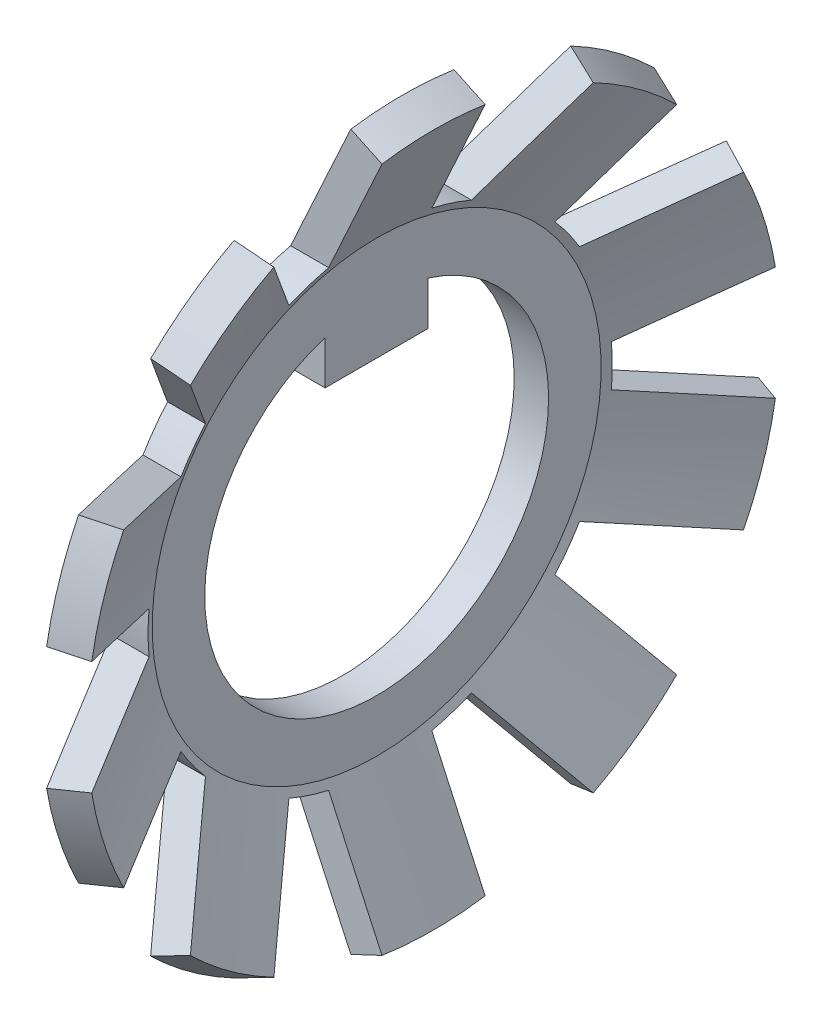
ISO-10303-21;
HEADER;
FILE_DESCRIPTION(('STEP AP214'),'2;1');
FILE_NAME('part.step','',(''),(''),'','','');
FILE_SCHEMA(('AUTOMOTIVE_DESIGN { 1 0 10303 214 1 1 1 1 }'));
ENDSEC;
DATA;
#1=APPLICATION_CONTEXT('core data for automotive mechanical design processes');
#2=APPLICATION_PROTOCOL_DEFINITION('international standard','automotive_design',2000,#1);
#3=PRODUCT_CONTEXT('',#1,'mechanical');
#4=PRODUCT('Part','Part','',(#3));
#5=PRODUCT_RELATED_PRODUCT_CATEGORY('part','',(#4));
#6=PRODUCT_DEFINITION_FORMATION('','',#4);
#7=PRODUCT_DEFINITION_CONTEXT('part definition',#1,'design');
#8=PRODUCT_DEFINITION('design','',#6,#7);
#9=PRODUCT_DEFINITION_SHAPE('','',#8);
#10=(LENGTH_UNIT() NAMED_UNIT(*) SI_UNIT(.MILLI.,.METRE.));
#11=(NAMED_UNIT(*) PLANE_ANGLE_UNIT() SI_UNIT($,.RADIAN.));
#12=(NAMED_UNIT(*) SI_UNIT($,.STERADIAN.) SOLID_ANGLE_UNIT());
#13=UNCERTAINTY_MEASURE_WITH_UNIT(LENGTH_MEASURE(1.E-05),#10,'distance_accuracy_value','');
#14=(GEOMETRIC_REPRESENTATION_CONTEXT(3) GLOBAL_UNCERTAINTY_ASSIGNED_CONTEXT((#13)) GLOBAL_UNIT_ASSIGNED_CONTEXT((#10,
#11,#12)) REPRESENTATION_CONTEXT('',''));
#15=CARTESIAN_POINT('',(0.,0.,0.));
#16=DIRECTION('',(0.,0.,1.));
#17=DIRECTION('',(1.,0.,0.));
#18=AXIS2_PLACEMENT_3D('',#15,#16,#17);
#19=CARTESIAN_POINT('',(0.,3.375,0.));
#20=DIRECTION('',(-1.,0.,0.));
#21=DIRECTION('',(0.,0.,1.));
#22=AXIS2_PLACEMENT_3D('',#19,#20,#21);
#23=PLANE('',#22);
#24=DIRECTION('',(0.,1.,0.));
#25=VECTOR('',#24,1.);
#26=CARTESIAN_POINT('',(0.,4.07234800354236,1.5));
#27=LINE('',#26,#25);
#28=CARTESIAN_POINT('',(0.,3.5,1.5));
#29=VERTEX_POINT('',#28);
#30=CARTESIAN_POINT('',(0.,4.76969600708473,1.5));
#31=VERTEX_POINT('',#30);
#32=EDGE_CURVE('E9',#29,#31,#27,.T.);
#33=ORIENTED_EDGE('',*,*,#32,.T.);
#34=CARTESIAN_POINT('',(0.,0.,0.));
#35=DIRECTION('',(1.,0.,0.));
#36=DIRECTION('',(0.,0.953939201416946,0.3));
#37=AXIS2_PLACEMENT_3D('',#34,#35,#36);
#38=CIRCLE('',#37,5.);
#39=CARTESIAN_POINT('',(0.,4.76969600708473,-1.5));
#40=VERTEX_POINT('',#39);
#41=EDGE_CURVE('E26',#31,#40,#38,.T.);
#42=ORIENTED_EDGE('',*,*,#41,.T.);
#43=DIRECTION('',(0.,-1.,0.));
#44=VECTOR('',#43,1.);
#45=CARTESIAN_POINT('',(0.,3.4375,-1.5));
#46=LINE('',#45,#44);
#47=CARTESIAN_POINT('',(0.,3.5,-1.5));
#48=VERTEX_POINT('',#47);
#49=EDGE_CURVE('E628',#40,#48,#46,.T.);
#50=ORIENTED_EDGE('',*,*,#49,.T.);
#51=DIRECTION('',(0.,0.,1.));
#52=VECTOR('',#51,1.);
#53=CARTESIAN_POINT('',(0.,3.5,0.75));
#54=LINE('',#53,#52);
#55=EDGE_CURVE('E601',#48,#29,#54,.T.);
#56=ORIENTED_EDGE('',*,*,#55,.T.);
#57=EDGE_LOOP('',(#33,#42,#50,#56));
#58=FACE_BOUND('',#57,.T.);
#59=CARTESIAN_POINT('',(0.,0.,0.));
#60=DIRECTION('',(-1.,0.,0.));
#61=DIRECTION('',(0.,1.,0.));
#62=AXIS2_PLACEMENT_3D('',#59,#60,#61);
#63=CIRCLE('',#62,6.75);
#64=CARTESIAN_POINT('',(0.,6.58122329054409,1.5));
#65=VERTEX_POINT('',#64);
#66=CARTESIAN_POINT('',(0.,6.5812232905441,-1.5));
#67=VERTEX_POINT('',#66);
#68=EDGE_CURVE('E597',#65,#67,#63,.T.);
#69=ORIENTED_EDGE('',*,*,#68,.T.);
#70=CARTESIAN_POINT('',(0.,0.,0.));
#71=DIRECTION('',(-1.,0.,0.));
#72=DIRECTION('',(0.,1.,0.));
#73=AXIS2_PLACEMENT_3D('',#70,#71,#72);
#74=CIRCLE('',#73,6.75);
#75=CARTESIAN_POINT('',(0.,6.20599936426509,-2.65482050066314));
#76=VERTEX_POINT('',#75);
#77=EDGE_CURVE('E479',#67,#76,#74,.T.);
#78=ORIENTED_EDGE('',*,*,#77,.T.);
#79=CARTESIAN_POINT('',(0.,0.,0.));
#80=DIRECTION('',(-1.,0.,0.));
#81=DIRECTION('',(0.,1.,0.));
#82=AXIS2_PLACEMENT_3D('',#79,#80,#81);
#83=CIRCLE('',#82,6.75);
#84=CARTESIAN_POINT('',(0.,4.44264360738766,-5.08187148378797));
#85=VERTEX_POINT('',#84);
#86=EDGE_CURVE('E472',#76,#85,#83,.T.);
#87=ORIENTED_EDGE('',*,*,#86,.T.);
#88=CARTESIAN_POINT('',(0.,0.,0.));
#89=DIRECTION('',(-1.,0.,0.));
#90=DIRECTION('',(0.,1.,0.));
#91=AXIS2_PLACEMENT_3D('',#88,#89,#90);
#92=CIRCLE('',#91,6.75);
#93=CARTESIAN_POINT('',(0.,3.46029461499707,-5.79558980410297));
#94=VERTEX_POINT('',#93);
#95=EDGE_CURVE('E480',#85,#94,#92,.T.);
#96=ORIENTED_EDGE('',*,*,#95,.T.);
#97=CARTESIAN_POINT('',(0.,0.,0.));
#98=DIRECTION('',(-1.,0.,0.));
#99=DIRECTION('',(0.,1.,0.));
#100=AXIS2_PLACEMENT_3D('',#97,#98,#99);
#101=CIRCLE('',#100,6.75);
#102=CARTESIAN_POINT('',(0.,0.607125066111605,-6.72264078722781));
#103=VERTEX_POINT('',#102);
#104=EDGE_CURVE('E897',#94,#103,#101,.T.);
#105=ORIENTED_EDGE('',*,*,#104,.T.);
#106=CARTESIAN_POINT('',(0.,0.,0.));
#107=DIRECTION('',(-1.,0.,0.));
#108=DIRECTION('',(0.,1.,0.));
#109=AXIS2_PLACEMENT_3D('',#106,#107,#108);
#110=CIRCLE('',#109,6.75);
#111=CARTESIAN_POINT('',(0.,-0.607125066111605,-6.72264078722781));
#112=VERTEX_POINT('',#111);
#113=EDGE_CURVE('E566',#103,#112,#110,.T.);
#114=ORIENTED_EDGE('',*,*,#113,.T.);
#115=CARTESIAN_POINT('',(0.,0.,0.));
#116=DIRECTION('',(-1.,0.,0.));
#117=DIRECTION('',(0.,1.,0.));
#118=AXIS2_PLACEMENT_3D('',#115,#116,#117);
#119=CIRCLE('',#118,6.75);
#120=CARTESIAN_POINT('',(0.,-3.46029461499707,-5.79558980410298));
#121=VERTEX_POINT('',#120);
#122=EDGE_CURVE('E562',#112,#121,#119,.T.);
#123=ORIENTED_EDGE('',*,*,#122,.T.);
#124=CARTESIAN_POINT('',(0.,0.,0.));
#125=DIRECTION('',(-1.,0.,0.));
#126=DIRECTION('',(0.,1.,0.));
#127=AXIS2_PLACEMENT_3D('',#124,#125,#126);
#128=CIRCLE('',#127,6.75);
#129=CARTESIAN_POINT('',(0.,-4.44264360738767,-5.08187148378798));
#130=VERTEX_POINT('',#129);
#131=EDGE_CURVE('E567',#121,#130,#128,.T.);
#132=ORIENTED_EDGE('',*,*,#131,.T.);
#133=CARTESIAN_POINT('',(0.,0.,0.));
#134=DIRECTION('',(-1.,0.,0.));
#135=DIRECTION('',(0.,1.,0.));
#136=AXIS2_PLACEMENT_3D('',#133,#134,#135);
#137=CIRCLE('',#136,6.75);
#138=CARTESIAN_POINT('',(0.,-6.20599936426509,-2.65482050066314));
#139=VERTEX_POINT('',#138);
#140=EDGE_CURVE('E606',#130,#139,#137,.T.);
#141=ORIENTED_EDGE('',*,*,#140,.T.);
#142=CARTESIAN_POINT('',(0.,0.,0.));
#143=DIRECTION('',(-1.,0.,0.));
#144=DIRECTION('',(0.,1.,0.));
#145=AXIS2_PLACEMENT_3D('',#142,#143,#144);
#146=CIRCLE('',#145,6.75);
#147=CARTESIAN_POINT('',(0.,-6.58122329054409,-1.5));
#148=VERTEX_POINT('',#147);
#149=EDGE_CURVE('E605',#139,#148,#146,.T.);
#150=ORIENTED_EDGE('',*,*,#149,.T.);
#151=CARTESIAN_POINT('',(0.,0.,0.));
#152=DIRECTION('',(-1.,0.,0.));
#153=DIRECTION('',(0.,1.,0.));
#154=AXIS2_PLACEMENT_3D('',#151,#152,#153);
#155=CIRCLE('',#154,6.75);
#156=CARTESIAN_POINT('',(0.,-6.5812232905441,1.5));
#157=VERTEX_POINT('',#156);
#158=EDGE_CURVE('E315',#148,#157,#155,.T.);
#159=ORIENTED_EDGE('',*,*,#158,.T.);
#160=CARTESIAN_POINT('',(0.,0.,0.));
#161=DIRECTION('',(-1.,0.,0.));
#162=DIRECTION('',(0.,1.,0.));
#163=AXIS2_PLACEMENT_3D('',#160,#161,#162);
#164=CIRCLE('',#163,6.75);
#165=CARTESIAN_POINT('',(0.,-6.20599936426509,2.65482050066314));
#166=VERTEX_POINT('',#165);
#167=EDGE_CURVE('E308',#157,#166,#164,.T.);
#168=ORIENTED_EDGE('',*,*,#167,.T.);
#169=CARTESIAN_POINT('',(0.,0.,0.));
#170=DIRECTION('',(-1.,0.,0.));
#171=DIRECTION('',(0.,1.,0.));
#172=AXIS2_PLACEMENT_3D('',#169,#170,#171);
#173=CIRCLE('',#172,6.75);
#174=CARTESIAN_POINT('',(0.,-4.44264360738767,5.08187148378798));
#175=VERTEX_POINT('',#174);
#176=EDGE_CURVE('E316',#166,#175,#173,.T.);
#177=ORIENTED_EDGE('',*,*,#176,.T.);
#178=CARTESIAN_POINT('',(0.,0.,0.));
#179=DIRECTION('',(-1.,0.,0.));
#180=DIRECTION('',(0.,1.,0.));
#181=AXIS2_PLACEMENT_3D('',#178,#179,#180);
#182=CIRCLE('',#181,6.75);
#183=CARTESIAN_POINT('',(0.,-3.46029461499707,5.79558980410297));
#184=VERTEX_POINT('',#183);
#185=EDGE_CURVE('E635',#175,#184,#182,.T.);
#186=ORIENTED_EDGE('',*,*,#185,.T.);
#187=CARTESIAN_POINT('',(0.,0.,0.));
#188=DIRECTION('',(-1.,0.,0.));
#189=DIRECTION('',(0.,1.,0.));
#190=AXIS2_PLACEMENT_3D('',#187,#188,#189);
#191=CIRCLE('',#190,6.75);
#192=CARTESIAN_POINT('',(0.,-0.607125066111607,6.72264078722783));
#193=VERTEX_POINT('',#192);
#194=EDGE_CURVE('E965',#184,#193,#191,.T.);
#195=ORIENTED_EDGE('',*,*,#194,.T.);
#196=CARTESIAN_POINT('',(0.,0.,0.));
#197=DIRECTION('',(-1.,0.,0.));
#198=DIRECTION('',(0.,1.,0.));
#199=AXIS2_PLACEMENT_3D('',#196,#197,#198);
#200=CIRCLE('',#199,6.75);
#201=CARTESIAN_POINT('',(0.,0.607125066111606,6.72264078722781));
#202=VERTEX_POINT('',#201);
#203=EDGE_CURVE('E484',#193,#202,#200,.T.);
#204=ORIENTED_EDGE('',*,*,#203,.T.);
#205=CARTESIAN_POINT('',(0.,0.,0.));
#206=DIRECTION('',(-1.,0.,0.));
#207=DIRECTION('',(0.,1.,0.));
#208=AXIS2_PLACEMENT_3D('',#205,#206,#207);
#209=CIRCLE('',#208,6.75);
#210=CARTESIAN_POINT('',(0.,3.46029461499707,5.79558980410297));
#211=VERTEX_POINT('',#210);
#212=EDGE_CURVE('E298',#202,#211,#209,.T.);
#213=ORIENTED_EDGE('',*,*,#212,.T.);
#214=CARTESIAN_POINT('',(0.,0.,0.));
#215=DIRECTION('',(-1.,0.,0.));
#216=DIRECTION('',(0.,1.,0.));
#217=AXIS2_PLACEMENT_3D('',#214,#215,#216);
#218=CIRCLE('',#217,6.75);
#219=CARTESIAN_POINT('',(0.,4.44264360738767,5.08187148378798));
#220=VERTEX_POINT('',#219);
#221=EDGE_CURVE('E294',#211,#220,#218,.T.);
#222=ORIENTED_EDGE('',*,*,#221,.T.);
#223=CARTESIAN_POINT('',(0.,0.,0.));
#224=DIRECTION('',(-1.,0.,0.));
#225=DIRECTION('',(0.,1.,0.));
#226=AXIS2_PLACEMENT_3D('',#223,#224,#225);
#227=CIRCLE('',#226,6.75);
#228=CARTESIAN_POINT('',(0.,6.2059993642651,2.65482050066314));
#229=VERTEX_POINT('',#228);
#230=EDGE_CURVE('E299',#220,#229,#227,.T.);
#231=ORIENTED_EDGE('',*,*,#230,.T.);
#232=CARTESIAN_POINT('',(0.,0.,0.));
#233=DIRECTION('',(-1.,0.,0.));
#234=DIRECTION('',(0.,1.,0.));
#235=AXIS2_PLACEMENT_3D('',#232,#233,#234);
#236=CIRCLE('',#235,6.75);
#237=EDGE_CURVE('E502',#229,#65,#236,.T.);
#238=ORIENTED_EDGE('',*,*,#237,.T.);
#239=EDGE_LOOP('',(#69,#78,#87,#96,#105,#114,#123,#132,#141,#150,#159,#168,#177,#186,#195,#204,
#213,#222,#231,#238));
#240=FACE_BOUND('',#239,.T.);
#241=ADVANCED_FACE('F15',(#58,#240),#23,.T.);
#242=DIRECTION('',(0.906307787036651,-0.422618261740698,0.));
#243=VECTOR('',#242,1.);
#244=CARTESIAN_POINT('',(2.20180761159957,10.2886908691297,0.));
#245=LINE('',#244,#243);
#246=CARTESIAN_POINT('',(24.2659763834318,0.,0.));
#247=DIRECTION('',(-1.,0.,0.));
#248=AXIS1_PLACEMENT('',#246,#247);
#249=SURFACE_OF_REVOLUTION('',#245,#248);
#250=CARTESIAN_POINT('',(1.74865371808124,-7.52587335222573,-7.32196901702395));
#251=CARTESIAN_POINT('',(2.21131668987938,-7.34952461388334,-7.1938441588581));
#252=CARTESIAN_POINT('',(2.65496150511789,-7.18027379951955,-7.07087624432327));
#253=(BOUNDED_CURVE() B_SPLINE_CURVE(2,(#250,#251,#252),.UNSPECIFIED.,.F.,
.F.) B_SPLINE_CURVE_WITH_KNOTS((3,3),(0.,1.0019383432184),
.UNSPECIFIED.) CURVE() GEOMETRIC_REPRESENTATION_ITEM() RATIONAL_B_SPLINE_CURVE((1.,
1.00021555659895,1.)) REPRESENTATION_ITEM(''));
#254=CARTESIAN_POINT('',(1.74865371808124,-7.52587335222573,-7.32196901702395));
#255=VERTEX_POINT('',#254);
#256=CARTESIAN_POINT('',(2.65496150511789,-7.18027379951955,-7.07087624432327));
#257=VERTEX_POINT('',#256);
#258=EDGE_CURVE('E493',#255,#257,#253,.T.);
#259=ORIENTED_EDGE('',*,*,#258,.T.);
#260=CARTESIAN_POINT('',(2.65496150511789,0.,0.));
#261=DIRECTION('',(-1.,0.,0.));
#262=DIRECTION('',(0.,1.,0.));
#263=AXIS2_PLACEMENT_3D('',#260,#261,#262);
#264=CIRCLE('',#263,10.0773817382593);
#265=CARTESIAN_POINT('',(2.65496150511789,-8.94362955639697,-4.64382526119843));
#266=VERTEX_POINT('',#265);
#267=EDGE_CURVE('E450',#257,#266,#264,.T.);
#268=ORIENTED_EDGE('',*,*,#267,.T.);
#269=CARTESIAN_POINT('',(2.65496150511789,-8.94362955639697,-4.64382526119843));
#270=CARTESIAN_POINT('',(2.21131669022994,-9.11288037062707,-4.76679317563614));
#271=CARTESIAN_POINT('',(1.74865371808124,-9.28922910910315,-4.8949180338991));
#272=(BOUNDED_CURVE() B_SPLINE_CURVE(2,(#269,#270,#271),.UNSPECIFIED.,.F.,
.F.) B_SPLINE_CURVE_WITH_KNOTS((3,3),(0.,1.0019383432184),
.UNSPECIFIED.) CURVE() GEOMETRIC_REPRESENTATION_ITEM() RATIONAL_B_SPLINE_CURVE((1.,
1.00021555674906,1.)) REPRESENTATION_ITEM(''));
#273=CARTESIAN_POINT('',(1.74865371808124,-9.28922910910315,-4.89491803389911));
#274=VERTEX_POINT('',#273);
#275=EDGE_CURVE('E444',#266,#274,#272,.T.);
#276=ORIENTED_EDGE('',*,*,#275,.T.);
#277=CARTESIAN_POINT('',(1.74865371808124,0.,0.));
#278=DIRECTION('',(-1.,0.,0.));
#279=DIRECTION('',(0.,1.,0.));
#280=AXIS2_PLACEMENT_3D('',#277,#278,#279);
#281=CIRCLE('',#280,10.5);
#282=EDGE_CURVE('E307',#255,#274,#281,.T.);
#283=ORIENTED_EDGE('',*,*,#282,.F.);
#284=EDGE_LOOP('',(#259,#268,#276,#283));
#285=FACE_BOUND('',#284,.T.);
#286=ADVANCED_FACE('F710',(#285),#249,.F.);
#287=CARTESIAN_POINT('',(1.,3.26415266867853,0.));
#288=DIRECTION('',(1.,0.,0.));
#289=DIRECTION('',(0.,0.,-1.));
#290=AXIS2_PLACEMENT_3D('',#287,#288,#289);
#291=PLANE('',#290);
#292=DIRECTION('',(0.,-1.,0.));
#293=VECTOR('',#292,1.);
#294=CARTESIAN_POINT('',(1.,4.01692433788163,1.5));
#295=LINE('',#294,#293);
#296=CARTESIAN_POINT('',(1.,4.76969600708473,1.5));
#297=VERTEX_POINT('',#296);
#298=CARTESIAN_POINT('',(1.,3.5,1.5));
#299=VERTEX_POINT('',#298);
#300=EDGE_CURVE('E451',#297,#299,#295,.T.);
#301=ORIENTED_EDGE('',*,*,#300,.T.);
#302=DIRECTION('',(0.,0.,-1.));
#303=VECTOR('',#302,1.);
#304=CARTESIAN_POINT('',(1.,3.5,0.75));
#305=LINE('',#304,#303);
#306=CARTESIAN_POINT('',(1.,3.5,-1.5));
#307=VERTEX_POINT('',#306);
#308=EDGE_CURVE('E556',#299,#307,#305,.T.);
#309=ORIENTED_EDGE('',*,*,#308,.T.);
#310=DIRECTION('',(0.,1.,0.));
#311=VECTOR('',#310,1.);
#312=CARTESIAN_POINT('',(1.,3.38207633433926,-1.5));
#313=LINE('',#312,#311);
#314=CARTESIAN_POINT('',(1.,4.76969600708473,-1.5));
#315=VERTEX_POINT('',#314);
#316=EDGE_CURVE('E552',#307,#315,#313,.T.);
#317=ORIENTED_EDGE('',*,*,#316,.T.);
#318=CARTESIAN_POINT('',(1.,0.,0.));
#319=DIRECTION('',(-1.,0.,0.));
#320=DIRECTION('',(0.,0.953939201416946,0.3));
#321=AXIS2_PLACEMENT_3D('',#318,#319,#320);
#322=CIRCLE('',#321,5.);
#323=EDGE_CURVE('E557',#315,#297,#322,.T.);
#324=ORIENTED_EDGE('',*,*,#323,.T.);
#325=EDGE_LOOP('',(#301,#309,#317,#324));
#326=FACE_BOUND('',#325,.T.);
#327=CARTESIAN_POINT('',(1.,0.,0.));
#328=DIRECTION('',(-1.,0.,0.));
#329=DIRECTION('',(0.,1.,0.));
#330=AXIS2_PLACEMENT_3D('',#327,#328,#329);
#331=CIRCLE('',#330,6.52830533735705);
#332=CARTESIAN_POINT('',(1.,6.52830533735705,0.));
#333=VERTEX_POINT('',#332);
#334=EDGE_CURVE('E471',#333,#333,#331,.T.);
#335=ORIENTED_EDGE('',*,*,#334,.F.);
#336=EDGE_LOOP('',(#335));
#337=FACE_BOUND('',#336,.T.);
#338=ADVANCED_FACE('F714',(#326,#337),#291,.T.);
#339=CARTESIAN_POINT('',(0.,3.5,-1.5));
#340=DIRECTION('',(0.,0.,-1.));
#341=DIRECTION('',(-1.,0.,0.));
#342=AXIS2_PLACEMENT_3D('',#339,#340,#341);
#343=PLANE('',#342);
#344=ORIENTED_EDGE('',*,*,#316,.F.);
#345=DIRECTION('',(1.,0.,0.));
#346=VECTOR('',#345,1.);
#347=CARTESIAN_POINT('',(0.,3.5,-1.5));
#348=LINE('',#347,#346);
#349=EDGE_CURVE('E292',#48,#307,#348,.T.);
#350=ORIENTED_EDGE('',*,*,#349,.F.);
#351=ORIENTED_EDGE('',*,*,#49,.F.);
#352=DIRECTION('',(1.,0.,0.));
#353=VECTOR('',#352,1.);
#354=CARTESIAN_POINT('',(0.,4.76969600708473,-1.5));
#355=LINE('',#354,#353);
#356=EDGE_CURVE('E561',#40,#315,#355,.T.);
#357=ORIENTED_EDGE('',*,*,#356,.T.);
#358=EDGE_LOOP('',(#344,#350,#351,#357));
#359=FACE_BOUND('',#358,.T.);
#360=ADVANCED_FACE('F718',(#359),#343,.T.);
#361=CARTESIAN_POINT('',(0.,3.5,1.5));
#362=DIRECTION('',(0.,-1.,0.));
#363=DIRECTION('',(0.,0.,-1.));
#364=AXIS2_PLACEMENT_3D('',#361,#362,#363);
#365=PLANE('',#364);
#366=ORIENTED_EDGE('',*,*,#308,.F.);
#367=DIRECTION('',(1.,0.,0.));
#368=VECTOR('',#367,1.);
#369=CARTESIAN_POINT('',(0.,3.5,1.5));
#370=LINE('',#369,#368);
#371=EDGE_CURVE('E288',#29,#299,#370,.T.);
#372=ORIENTED_EDGE('',*,*,#371,.F.);
#373=ORIENTED_EDGE('',*,*,#55,.F.);
#374=ORIENTED_EDGE('',*,*,#349,.T.);
#375=EDGE_LOOP('',(#366,#372,#373,#374));
#376=FACE_BOUND('',#375,.T.);
#377=ADVANCED_FACE('F722',(#376),#365,.T.);
#378=CARTESIAN_POINT('',(0.,4.76969600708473,1.5));
#379=DIRECTION('',(0.,0.,1.));
#380=DIRECTION('',(1.,0.,0.));
#381=AXIS2_PLACEMENT_3D('',#378,#379,#380);
#382=PLANE('',#381);
#383=ORIENTED_EDGE('',*,*,#300,.F.);
#384=DIRECTION('',(1.,0.,0.));
#385=VECTOR('',#384,1.);
#386=CARTESIAN_POINT('',(0.,4.76969600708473,1.5));
#387=LINE('',#386,#385);
#388=EDGE_CURVE('E35',#31,#297,#387,.T.);
#389=ORIENTED_EDGE('',*,*,#388,.F.);
#390=ORIENTED_EDGE('',*,*,#32,.F.);
#391=ORIENTED_EDGE('',*,*,#371,.T.);
#392=EDGE_LOOP('',(#383,#389,#390,#391));
#393=FACE_BOUND('',#392,.T.);
#394=ADVANCED_FACE('F726',(#393),#382,.T.);
#395=DIRECTION('',(0.906307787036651,-0.422618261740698,0.));
#396=VECTOR('',#395,1.);
#397=CARTESIAN_POINT('',(2.20180761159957,10.2886908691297,0.));
#398=LINE('',#397,#396);
#399=CARTESIAN_POINT('',(24.2659763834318,0.,0.));
#400=DIRECTION('',(-1.,0.,0.));
#401=AXIS1_PLACEMENT('',#399,#400);
#402=SURFACE_OF_REVOLUTION('',#398,#401);
#403=CARTESIAN_POINT('',(2.65496150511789,-4.50597629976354,-9.01386711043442));
#404=CARTESIAN_POINT('',(2.2113166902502,-4.5706243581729,-9.21283337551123));
#405=CARTESIAN_POINT('',(1.74865371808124,-4.63798358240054,-9.42014375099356));
#406=(BOUNDED_CURVE() B_SPLINE_CURVE(2,(#403,#404,#405),.UNSPECIFIED.,.F.,
.F.) B_SPLINE_CURVE_WITH_KNOTS((3,3),(0.,1.0019383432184),
.UNSPECIFIED.) CURVE() GEOMETRIC_REPRESENTATION_ITEM() RATIONAL_B_SPLINE_CURVE((1.,
1.00021555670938,1.)) REPRESENTATION_ITEM(''));
#407=CARTESIAN_POINT('',(2.65496150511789,-4.50597629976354,-9.01386711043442));
#408=VERTEX_POINT('',#407);
#409=CARTESIAN_POINT('',(1.74865371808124,-4.63798358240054,-9.42014375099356));
#410=VERTEX_POINT('',#409);
#411=EDGE_CURVE('E293',#408,#410,#406,.T.);
#412=ORIENTED_EDGE('',*,*,#411,.T.);
#413=CARTESIAN_POINT('',(1.74865371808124,0.,0.));
#414=DIRECTION('',(-1.,0.,0.));
#415=DIRECTION('',(0.,1.,0.));
#416=AXIS2_PLACEMENT_3D('',#413,#414,#415);
#417=CIRCLE('',#416,10.5);
#418=CARTESIAN_POINT('',(1.74865371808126,-1.78481403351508,-10.3471947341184));
#419=VERTEX_POINT('',#418);
#420=EDGE_CURVE('E413',#419,#410,#417,.T.);
#421=ORIENTED_EDGE('',*,*,#420,.F.);
#422=CARTESIAN_POINT('',(1.74865371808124,-1.78481403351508,-10.3471947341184));
#423=CARTESIAN_POINT('',(2.21131669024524,-1.71745480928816,-10.1398843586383));
#424=CARTESIAN_POINT('',(2.65496150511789,-1.65280675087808,-9.94091809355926));
#425=(BOUNDED_CURVE() B_SPLINE_CURVE(2,(#422,#423,#424),.UNSPECIFIED.,.F.,
.F.) B_SPLINE_CURVE_WITH_KNOTS((3,3),(0.,1.0019383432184),
.UNSPECIFIED.) CURVE() GEOMETRIC_REPRESENTATION_ITEM() RATIONAL_B_SPLINE_CURVE((1.,
1.00021555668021,1.)) REPRESENTATION_ITEM(''));
#426=CARTESIAN_POINT('',(2.65496150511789,-1.65280675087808,-9.94091809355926));
#427=VERTEX_POINT('',#426);
#428=EDGE_CURVE('E460',#419,#427,#425,.T.);
#429=ORIENTED_EDGE('',*,*,#428,.T.);
#430=CARTESIAN_POINT('',(2.65496150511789,0.,0.));
#431=DIRECTION('',(-1.,0.,0.));
#432=DIRECTION('',(0.,1.,0.));
#433=AXIS2_PLACEMENT_3D('',#430,#431,#432);
#434=CIRCLE('',#433,10.0773817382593);
#435=EDGE_CURVE('E1015',#427,#408,#434,.T.);
#436=ORIENTED_EDGE('',*,*,#435,.T.);
#437=EDGE_LOOP('',(#412,#421,#429,#436));
#438=FACE_BOUND('',#437,.T.);
#439=ADVANCED_FACE('F730',(#438),#402,.F.);
#440=DIRECTION('',(0.906307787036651,-0.422618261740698,0.));
#441=VECTOR('',#440,1.);
#442=CARTESIAN_POINT('',(2.20180761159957,10.2886908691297,0.));
#443=LINE('',#442,#441);
#444=CARTESIAN_POINT('',(24.2659763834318,0.,0.));
#445=DIRECTION('',(-1.,0.,0.));
#446=AXIS1_PLACEMENT('',#444,#445);
#447=SURFACE_OF_REVOLUTION('',#443,#446);
#448=CARTESIAN_POINT('',(2.65496150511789,1.65280675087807,-9.94091809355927));
#449=CARTESIAN_POINT('',(2.21131668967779,1.7174548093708,-10.1398843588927));
#450=CARTESIAN_POINT('',(1.74865371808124,1.78481403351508,-10.3471947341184));
#451=(BOUNDED_CURVE() B_SPLINE_CURVE(2,(#448,#449,#450),.UNSPECIFIED.,.F.,
.F.) B_SPLINE_CURVE_WITH_KNOTS((3,3),(0.,1.0019383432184),
.UNSPECIFIED.) CURVE() GEOMETRIC_REPRESENTATION_ITEM() RATIONAL_B_SPLINE_CURVE((1.,
1.00021555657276,1.)) REPRESENTATION_ITEM(''));
#452=CARTESIAN_POINT('',(2.65496150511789,1.65280675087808,-9.94091809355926));
#453=VERTEX_POINT('',#452);
#454=CARTESIAN_POINT('',(1.74865371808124,1.78481403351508,-10.3471947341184));
#455=VERTEX_POINT('',#454);
#456=EDGE_CURVE('E1047',#453,#455,#451,.T.);
#457=ORIENTED_EDGE('',*,*,#456,.T.);
#458=CARTESIAN_POINT('',(1.74865371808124,0.,0.));
#459=DIRECTION('',(-1.,0.,0.));
#460=DIRECTION('',(0.,1.,0.));
#461=AXIS2_PLACEMENT_3D('',#458,#459,#460);
#462=CIRCLE('',#461,10.5);
#463=CARTESIAN_POINT('',(1.74865371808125,4.63798358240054,-9.42014375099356));
#464=VERTEX_POINT('',#463);
#465=EDGE_CURVE('E577',#464,#455,#462,.T.);
#466=ORIENTED_EDGE('',*,*,#465,.F.);
#467=CARTESIAN_POINT('',(1.74865371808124,4.63798358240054,-9.42014375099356));
#468=CARTESIAN_POINT('',(2.2113166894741,4.57062435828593,-9.21283337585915));
#469=CARTESIAN_POINT('',(2.65496150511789,4.50597629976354,-9.01386711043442));
#470=(BOUNDED_CURVE() B_SPLINE_CURVE(2,(#467,#468,#469),.UNSPECIFIED.,.F.,
.F.) B_SPLINE_CURVE_WITH_KNOTS((3,3),(0.,1.0019383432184),
.UNSPECIFIED.) CURVE() GEOMETRIC_REPRESENTATION_ITEM() RATIONAL_B_SPLINE_CURVE((1.,
1.000215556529,1.)) REPRESENTATION_ITEM(''));
#471=CARTESIAN_POINT('',(2.65496150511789,4.50597629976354,-9.01386711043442));
#472=VERTEX_POINT('',#471);
#473=EDGE_CURVE('E656',#464,#472,#470,.T.);
#474=ORIENTED_EDGE('',*,*,#473,.T.);
#475=CARTESIAN_POINT('',(2.65496150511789,0.,0.));
#476=DIRECTION('',(-1.,0.,0.));
#477=DIRECTION('',(0.,1.,0.));
#478=AXIS2_PLACEMENT_3D('',#475,#476,#477);
#479=CIRCLE('',#478,10.0773817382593);
#480=EDGE_CURVE('E423',#472,#453,#479,.T.);
#481=ORIENTED_EDGE('',*,*,#480,.T.);
#482=EDGE_LOOP('',(#457,#466,#474,#481));
#483=FACE_BOUND('',#482,.T.);
#484=ADVANCED_FACE('F733',(#483),#447,.F.);
#485=DIRECTION('',(0.906307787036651,-0.422618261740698,0.));
#486=VECTOR('',#485,1.);
#487=CARTESIAN_POINT('',(2.20180761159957,10.2886908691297,0.));
#488=LINE('',#487,#486);
#489=CARTESIAN_POINT('',(24.2659763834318,0.,0.));
#490=DIRECTION('',(-1.,0.,0.));
#491=AXIS1_PLACEMENT('',#489,#490);
#492=SURFACE_OF_REVOLUTION('',#488,#491);
#493=CARTESIAN_POINT('',(1.74865371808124,-9.28922910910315,4.89491803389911));
#494=CARTESIAN_POINT('',(2.21131668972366,-9.11288037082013,4.76679317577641));
#495=CARTESIAN_POINT('',(2.65496150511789,-8.94362955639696,4.64382526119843));
#496=(BOUNDED_CURVE() B_SPLINE_CURVE(2,(#493,#494,#495),.UNSPECIFIED.,.F.,
.F.) B_SPLINE_CURVE_WITH_KNOTS((3,3),(0.,1.0019383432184),
.UNSPECIFIED.) CURVE() GEOMETRIC_REPRESENTATION_ITEM() RATIONAL_B_SPLINE_CURVE((1.,
1.00021555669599,1.)) REPRESENTATION_ITEM(''));
#497=CARTESIAN_POINT('',(1.74865371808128,-9.28922910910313,4.8949180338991));
#498=VERTEX_POINT('',#497);
#499=CARTESIAN_POINT('',(2.65496150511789,-8.94362955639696,4.64382526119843));
#500=VERTEX_POINT('',#499);
#501=EDGE_CURVE('E414',#498,#500,#496,.T.);
#502=ORIENTED_EDGE('',*,*,#501,.T.);
#503=CARTESIAN_POINT('',(2.65496150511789,0.,0.));
#504=DIRECTION('',(-1.,0.,0.));
#505=DIRECTION('',(0.,1.,0.));
#506=AXIS2_PLACEMENT_3D('',#503,#504,#505);
#507=CIRCLE('',#506,10.0773817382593);
#508=CARTESIAN_POINT('',(2.65496150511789,-7.18027379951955,7.07087624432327));
#509=VERTEX_POINT('',#508);
#510=EDGE_CURVE('E424',#500,#509,#507,.T.);
#511=ORIENTED_EDGE('',*,*,#510,.T.);
#512=CARTESIAN_POINT('',(2.65496150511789,-7.18027379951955,7.07087624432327));
#513=CARTESIAN_POINT('',(2.21131668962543,-7.34952461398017,7.19384415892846));
#514=CARTESIAN_POINT('',(1.74865371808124,-7.52587335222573,7.32196901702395));
#515=(BOUNDED_CURVE() B_SPLINE_CURVE(2,(#512,#513,#514),.UNSPECIFIED.,.F.,
.F.) B_SPLINE_CURVE_WITH_KNOTS((3,3),(0.,1.0019383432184),
.UNSPECIFIED.) CURVE() GEOMETRIC_REPRESENTATION_ITEM() RATIONAL_B_SPLINE_CURVE((1.,
1.00021555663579,1.)) REPRESENTATION_ITEM(''));
#516=CARTESIAN_POINT('',(1.74865371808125,-7.52587335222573,7.32196901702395));
#517=VERTEX_POINT('',#516);
#518=EDGE_CURVE('E351',#509,#517,#515,.T.);
#519=ORIENTED_EDGE('',*,*,#518,.T.);
#520=CARTESIAN_POINT('',(1.74865371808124,0.,0.));
#521=DIRECTION('',(-1.,0.,0.));
#522=DIRECTION('',(0.,1.,0.));
#523=AXIS2_PLACEMENT_3D('',#520,#521,#522);
#524=CIRCLE('',#523,10.5);
#525=EDGE_CURVE('E522',#498,#517,#524,.T.);
#526=ORIENTED_EDGE('',*,*,#525,.F.);
#527=EDGE_LOOP('',(#502,#511,#519,#526));
#528=FACE_BOUND('',#527,.T.);
#529=ADVANCED_FACE('F737',(#528),#492,.F.);
#530=DIRECTION('',(0.906307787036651,-0.422618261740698,0.));
#531=VECTOR('',#530,1.);
#532=CARTESIAN_POINT('',(2.20180761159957,10.2886908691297,0.));
#533=LINE('',#532,#531);
#534=CARTESIAN_POINT('',(24.2659763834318,0.,0.));
#535=DIRECTION('',(-1.,0.,0.));
#536=AXIS1_PLACEMENT('',#534,#535);
#537=SURFACE_OF_REVOLUTION('',#533,#536);
#538=CARTESIAN_POINT('',(2.65496150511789,7.18027379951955,-7.07087624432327));
#539=CARTESIAN_POINT('',(2.2113166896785,7.34952461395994,-7.19384415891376));
#540=CARTESIAN_POINT('',(1.74865371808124,7.52587335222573,-7.32196901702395));
#541=(BOUNDED_CURVE() B_SPLINE_CURVE(2,(#538,#539,#540),.UNSPECIFIED.,.F.,
.F.) B_SPLINE_CURVE_WITH_KNOTS((3,3),(0.,1.0019383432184),
.UNSPECIFIED.) CURVE() GEOMETRIC_REPRESENTATION_ITEM() RATIONAL_B_SPLINE_CURVE((1.,
1.00021555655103,1.)) REPRESENTATION_ITEM(''));
#542=CARTESIAN_POINT('',(2.65496150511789,7.18027379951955,-7.07087624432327));
#543=VERTEX_POINT('',#542);
#544=CARTESIAN_POINT('',(1.74865371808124,7.52587335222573,-7.32196901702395));
#545=VERTEX_POINT('',#544);
#546=EDGE_CURVE('E342',#543,#545,#541,.T.);
#547=ORIENTED_EDGE('',*,*,#546,.T.);
#548=CARTESIAN_POINT('',(1.74865371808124,0.,0.));
#549=DIRECTION('',(-1.,0.,0.));
#550=DIRECTION('',(0.,1.,0.));
#551=AXIS2_PLACEMENT_3D('',#548,#549,#550);
#552=CIRCLE('',#551,10.5);
#553=CARTESIAN_POINT('',(1.74865371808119,9.28922910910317,-4.89491803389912));
#554=VERTEX_POINT('',#553);
#555=EDGE_CURVE('E492',#554,#545,#552,.T.);
#556=ORIENTED_EDGE('',*,*,#555,.F.);
#557=CARTESIAN_POINT('',(1.74865371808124,9.28922910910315,-4.8949180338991));
#558=CARTESIAN_POINT('',(2.21131668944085,9.11288037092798,-4.76679317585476));
#559=CARTESIAN_POINT('',(2.65496150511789,8.94362955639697,-4.64382526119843));
#560=(BOUNDED_CURVE() B_SPLINE_CURVE(2,(#557,#558,#559),.UNSPECIFIED.,.F.,
.F.) B_SPLINE_CURVE_WITH_KNOTS((3,3),(0.,1.0019383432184),
.UNSPECIFIED.) CURVE() GEOMETRIC_REPRESENTATION_ITEM() RATIONAL_B_SPLINE_CURVE((1.,
1.00021555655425,1.)) REPRESENTATION_ITEM(''));
#561=CARTESIAN_POINT('',(2.65496150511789,8.94362955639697,-4.64382526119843));
#562=VERTEX_POINT('',#561);
#563=EDGE_CURVE('E352',#554,#562,#560,.T.);
#564=ORIENTED_EDGE('',*,*,#563,.T.);
#565=CARTESIAN_POINT('',(2.65496150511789,0.,0.));
#566=DIRECTION('',(-1.,0.,0.));
#567=DIRECTION('',(0.,1.,0.));
#568=AXIS2_PLACEMENT_3D('',#565,#566,#567);
#569=CIRCLE('',#568,10.0773817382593);
#570=EDGE_CURVE('E613',#562,#543,#569,.T.);
#571=ORIENTED_EDGE('',*,*,#570,.T.);
#572=EDGE_LOOP('',(#547,#556,#564,#571));
#573=FACE_BOUND('',#572,.T.);
#574=ADVANCED_FACE('F748',(#573),#537,.F.);
#575=DIRECTION('',(0.906307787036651,-0.422618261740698,0.));
#576=VECTOR('',#575,1.);
#577=CARTESIAN_POINT('',(2.20180761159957,10.2886908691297,0.));
#578=LINE('',#577,#576);
#579=CARTESIAN_POINT('',(24.2659763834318,0.,0.));
#580=DIRECTION('',(-1.,0.,0.));
#581=AXIS1_PLACEMENT('',#579,#580);
#582=SURFACE_OF_REVOLUTION('',#578,#581);
#583=CARTESIAN_POINT('',(1.74865371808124,-4.63798358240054,9.42014375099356));
#584=CARTESIAN_POINT('',(2.21131668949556,-4.57062435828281,9.21283337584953));
#585=CARTESIAN_POINT('',(2.65496150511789,-4.50597629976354,9.01386711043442));
#586=(BOUNDED_CURVE() B_SPLINE_CURVE(2,(#583,#584,#585),.UNSPECIFIED.,.F.,
.F.) B_SPLINE_CURVE_WITH_KNOTS((3,3),(0.,1.0019383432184),
.UNSPECIFIED.) CURVE() GEOMETRIC_REPRESENTATION_ITEM() RATIONAL_B_SPLINE_CURVE((1.,
1.00021555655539,1.)) REPRESENTATION_ITEM(''));
#587=CARTESIAN_POINT('',(1.74865371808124,-4.63798358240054,9.42014375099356));
#588=VERTEX_POINT('',#587);
#589=CARTESIAN_POINT('',(2.65496150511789,-4.50597629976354,9.01386711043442));
#590=VERTEX_POINT('',#589);
#591=EDGE_CURVE('E617',#588,#590,#586,.T.);
#592=ORIENTED_EDGE('',*,*,#591,.T.);
#593=CARTESIAN_POINT('',(2.65496150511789,0.,0.));
#594=DIRECTION('',(-1.,0.,0.));
#595=DIRECTION('',(0.,1.,0.));
#596=AXIS2_PLACEMENT_3D('',#593,#594,#595);
#597=CIRCLE('',#596,10.0773817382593);
#598=CARTESIAN_POINT('',(2.65496150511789,-1.65280675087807,9.94091809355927));
#599=VERTEX_POINT('',#598);
#600=EDGE_CURVE('E888',#590,#599,#597,.T.);
#601=ORIENTED_EDGE('',*,*,#600,.T.);
#602=CARTESIAN_POINT('',(2.65496150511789,-1.65280675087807,9.94091809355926));
#603=CARTESIAN_POINT('',(2.21131668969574,-1.71745480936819,10.1398843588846));
#604=CARTESIAN_POINT('',(1.74865371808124,-1.78481403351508,10.3471947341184));
#605=(BOUNDED_CURVE() B_SPLINE_CURVE(2,(#602,#603,#604),.UNSPECIFIED.,.F.,
.F.) B_SPLINE_CURVE_WITH_KNOTS((3,3),(0.,1.0019383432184),
.UNSPECIFIED.) CURVE() GEOMETRIC_REPRESENTATION_ITEM() RATIONAL_B_SPLINE_CURVE((1.,
1.00021555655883,1.)) REPRESENTATION_ITEM(''));
#606=CARTESIAN_POINT('',(1.74865371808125,-1.78481403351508,10.3471947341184));
#607=VERTEX_POINT('',#606);
#608=EDGE_CURVE('E434',#599,#607,#605,.T.);
#609=ORIENTED_EDGE('',*,*,#608,.T.);
#610=CARTESIAN_POINT('',(1.74865371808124,0.,0.));
#611=DIRECTION('',(-1.,0.,0.));
#612=DIRECTION('',(0.,1.,0.));
#613=AXIS2_PLACEMENT_3D('',#610,#611,#612);
#614=CIRCLE('',#613,10.5);
#615=EDGE_CURVE('E1055',#588,#607,#614,.T.);
#616=ORIENTED_EDGE('',*,*,#615,.F.);
#617=EDGE_LOOP('',(#592,#601,#609,#616));
#618=FACE_BOUND('',#617,.T.);
#619=ADVANCED_FACE('F751',(#618),#582,.F.);
#620=DIRECTION('',(0.906307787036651,-0.422618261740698,0.));
#621=VECTOR('',#620,1.);
#622=CARTESIAN_POINT('',(2.20180761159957,10.2886908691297,0.));
#623=LINE('',#622,#621);
#624=CARTESIAN_POINT('',(24.2659763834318,0.,0.));
#625=DIRECTION('',(-1.,0.,0.));
#626=AXIS1_PLACEMENT('',#624,#625);
#627=SURFACE_OF_REVOLUTION('',#623,#626);
#628=CARTESIAN_POINT('',(1.74865371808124,1.78481403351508,10.3471947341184));
#629=CARTESIAN_POINT('',(2.21131668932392,1.71745480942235,10.1398843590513));
#630=CARTESIAN_POINT('',(2.65496150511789,1.65280675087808,9.94091809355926));
#631=(BOUNDED_CURVE() B_SPLINE_CURVE(2,(#628,#629,#630),.UNSPECIFIED.,.F.,
.F.) B_SPLINE_CURVE_WITH_KNOTS((3,3),(0.,1.0019383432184),
.UNSPECIFIED.) CURVE() GEOMETRIC_REPRESENTATION_ITEM() RATIONAL_B_SPLINE_CURVE((1.,
1.00021555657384,1.)) REPRESENTATION_ITEM(''));
#632=CARTESIAN_POINT('',(1.74865371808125,1.78481403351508,10.3471947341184));
#633=VERTEX_POINT('',#632);
#634=CARTESIAN_POINT('',(2.65496150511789,1.65280675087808,9.94091809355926));
#635=VERTEX_POINT('',#634);
#636=EDGE_CURVE('E425',#633,#635,#631,.T.);
#637=ORIENTED_EDGE('',*,*,#636,.T.);
#638=CARTESIAN_POINT('',(2.65496150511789,0.,0.));
#639=DIRECTION('',(-1.,0.,0.));
#640=DIRECTION('',(0.,1.,0.));
#641=AXIS2_PLACEMENT_3D('',#638,#639,#640);
#642=CIRCLE('',#641,10.0773817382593);
#643=CARTESIAN_POINT('',(2.65496150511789,4.50597629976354,9.01386711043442));
#644=VERTEX_POINT('',#643);
#645=EDGE_CURVE('E435',#635,#644,#642,.T.);
#646=ORIENTED_EDGE('',*,*,#645,.T.);
#647=CARTESIAN_POINT('',(2.65496150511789,4.50597629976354,9.01386711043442));
#648=CARTESIAN_POINT('',(2.21131668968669,4.57062435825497,9.21283337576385));
#649=CARTESIAN_POINT('',(1.74865371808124,4.63798358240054,9.42014375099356));
#650=(BOUNDED_CURVE() B_SPLINE_CURVE(2,(#647,#648,#649),.UNSPECIFIED.,.F.,
.F.) B_SPLINE_CURVE_WITH_KNOTS((3,3),(0.,1.0019383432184),
.UNSPECIFIED.) CURVE() GEOMETRIC_REPRESENTATION_ITEM() RATIONAL_B_SPLINE_CURVE((1.,
1.00021555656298,1.)) REPRESENTATION_ITEM(''));
#651=CARTESIAN_POINT('',(1.74865371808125,4.63798358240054,9.42014375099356));
#652=VERTEX_POINT('',#651);
#653=EDGE_CURVE('E1101',#644,#652,#650,.T.);
#654=ORIENTED_EDGE('',*,*,#653,.T.);
#655=CARTESIAN_POINT('',(1.74865371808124,0.,0.));
#656=DIRECTION('',(-1.,0.,0.));
#657=DIRECTION('',(0.,1.,0.));
#658=AXIS2_PLACEMENT_3D('',#655,#656,#657);
#659=CIRCLE('',#658,10.5);
#660=EDGE_CURVE('E330',#633,#652,#659,.T.);
#661=ORIENTED_EDGE('',*,*,#660,.F.);
#662=EDGE_LOOP('',(#637,#646,#654,#661));
#663=FACE_BOUND('',#662,.T.);
#664=ADVANCED_FACE('F755',(#663),#627,.F.);
#665=DIRECTION('',(0.906307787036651,-0.422618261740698,0.));
#666=VECTOR('',#665,1.);
#667=CARTESIAN_POINT('',(2.20180761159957,10.2886908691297,0.));
#668=LINE('',#667,#666);
#669=CARTESIAN_POINT('',(24.2659763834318,0.,0.));
#670=DIRECTION('',(-1.,0.,0.));
#671=AXIS1_PLACEMENT('',#669,#670);
#672=SURFACE_OF_REVOLUTION('',#668,#671);
#673=CARTESIAN_POINT('',(2.65496150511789,8.94362955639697,4.64382526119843));
#674=CARTESIAN_POINT('',(2.21131669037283,9.11288037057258,4.76679317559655));
#675=CARTESIAN_POINT('',(1.74865371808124,9.28922910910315,4.8949180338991));
#676=(BOUNDED_CURVE() B_SPLINE_CURVE(2,(#673,#674,#675),.UNSPECIFIED.,.F.,
.F.) B_SPLINE_CURVE_WITH_KNOTS((3,3),(0.,1.0019383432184),
.UNSPECIFIED.) CURVE() GEOMETRIC_REPRESENTATION_ITEM() RATIONAL_B_SPLINE_CURVE((1.,
1.00021555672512,1.)) REPRESENTATION_ITEM(''));
#677=CARTESIAN_POINT('',(2.65496150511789,8.94362955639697,4.64382526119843));
#678=VERTEX_POINT('',#677);
#679=CARTESIAN_POINT('',(1.74865371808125,9.28922910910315,4.8949180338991));
#680=VERTEX_POINT('',#679);
#681=EDGE_CURVE('E1110',#678,#680,#676,.T.);
#682=ORIENTED_EDGE('',*,*,#681,.T.);
#683=CARTESIAN_POINT('',(1.74865371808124,0.,0.));
#684=DIRECTION('',(-1.,0.,0.));
#685=DIRECTION('',(0.,1.,0.));
#686=AXIS2_PLACEMENT_3D('',#683,#684,#685);
#687=CIRCLE('',#686,10.5);
#688=CARTESIAN_POINT('',(1.74865371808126,7.52587335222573,7.32196901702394));
#689=VERTEX_POINT('',#688);
#690=EDGE_CURVE('E341',#689,#680,#687,.T.);
#691=ORIENTED_EDGE('',*,*,#690,.F.);
#692=CARTESIAN_POINT('',(1.74865371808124,7.52587335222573,7.32196901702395));
#693=CARTESIAN_POINT('',(2.21131668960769,7.34952461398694,7.19384415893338));
#694=CARTESIAN_POINT('',(2.65496150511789,7.18027379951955,7.07087624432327));
#695=(BOUNDED_CURVE() B_SPLINE_CURVE(2,(#692,#693,#694),.UNSPECIFIED.,.F.,
.F.) B_SPLINE_CURVE_WITH_KNOTS((3,3),(0.,1.0019383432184),
.UNSPECIFIED.) CURVE() GEOMETRIC_REPRESENTATION_ITEM() RATIONAL_B_SPLINE_CURVE((1.,
1.00021555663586,1.)) REPRESENTATION_ITEM(''));
#696=CARTESIAN_POINT('',(2.65496150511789,7.18027379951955,7.07087624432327));
#697=VERTEX_POINT('',#696);
#698=EDGE_CURVE('E869',#689,#697,#695,.T.);
#699=ORIENTED_EDGE('',*,*,#698,.T.);
#700=CARTESIAN_POINT('',(2.65496150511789,0.,0.));
#701=DIRECTION('',(-1.,0.,0.));
#702=DIRECTION('',(0.,1.,0.));
#703=AXIS2_PLACEMENT_3D('',#700,#701,#702);
#704=CIRCLE('',#703,10.0773817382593);
#705=EDGE_CURVE('E306',#697,#678,#704,.T.);
#706=ORIENTED_EDGE('',*,*,#705,.T.);
#707=EDGE_LOOP('',(#682,#691,#699,#706));
#708=FACE_BOUND('',#707,.T.);
#709=ADVANCED_FACE('F759',(#708),#672,.F.);
#710=DIRECTION('',(-0.422618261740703,-0.906307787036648,0.));
#711=VECTOR('',#710,1.);
#712=CARTESIAN_POINT('',(0.874326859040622,8.625,0.));
#713=LINE('',#712,#711);
#714=CARTESIAN_POINT('',(-3.14757669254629,0.,0.));
#715=DIRECTION('',(1.,0.,0.));
#716=AXIS1_PLACEMENT('',#714,#715);
#717=SURFACE_OF_REVOLUTION('',#713,#716);
#718=CARTESIAN_POINT('',(0.,-4.44264360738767,-5.08187148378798));
#719=CARTESIAN_POINT('',(0.678013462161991,-5.64912481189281,-5.95843138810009));
#720=CARTESIAN_POINT('',(1.74865371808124,-7.52587335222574,-7.32196901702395));
#721=(BOUNDED_CURVE() B_SPLINE_CURVE(2,(#718,#719,#720),.UNSPECIFIED.,.F.,
.F.) B_SPLINE_CURVE_WITH_KNOTS((3,3),(0.,4.19310932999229),
.UNSPECIFIED.) CURVE() GEOMETRIC_REPRESENTATION_ITEM() RATIONAL_B_SPLINE_CURVE((1.,
1.02533694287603,1.)) REPRESENTATION_ITEM(''));
#722=EDGE_CURVE('E300',#130,#255,#721,.T.);
#723=ORIENTED_EDGE('',*,*,#722,.T.);
#724=ORIENTED_EDGE('',*,*,#282,.T.);
#725=CARTESIAN_POINT('',(1.74865371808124,-9.28922910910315,-4.8949180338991));
#726=CARTESIAN_POINT('',(0.678013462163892,-7.41248056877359,-3.53138040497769));
#727=CARTESIAN_POINT('',(0.,-6.20599936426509,-2.65482050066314));
#728=(BOUNDED_CURVE() B_SPLINE_CURVE(2,(#725,#726,#727),.UNSPECIFIED.,.F.,
.F.) B_SPLINE_CURVE_WITH_KNOTS((3,3),(0.,4.19310932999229),
.UNSPECIFIED.) CURVE() GEOMETRIC_REPRESENTATION_ITEM() RATIONAL_B_SPLINE_CURVE((1.,
1.02533694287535,1.)) REPRESENTATION_ITEM(''));
#729=EDGE_CURVE('E925',#274,#139,#728,.T.);
#730=ORIENTED_EDGE('',*,*,#729,.T.);
#731=ORIENTED_EDGE('',*,*,#140,.F.);
#732=EDGE_LOOP('',(#723,#724,#730,#731));
#733=FACE_BOUND('',#732,.T.);
#734=ADVANCED_FACE('F770',(#733),#717,.F.);
#735=DIRECTION('',(-0.422618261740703,-0.906307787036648,0.));
#736=VECTOR('',#735,1.);
#737=CARTESIAN_POINT('',(0.874326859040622,8.625,0.));
#738=LINE('',#737,#736);
#739=CARTESIAN_POINT('',(-3.14757669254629,0.,0.));
#740=DIRECTION('',(1.,0.,0.));
#741=AXIS1_PLACEMENT('',#739,#740);
#742=SURFACE_OF_REVOLUTION('',#738,#741);
#743=CARTESIAN_POINT('',(1.74865371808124,-4.63798358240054,-9.42014375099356));
#744=CARTESIAN_POINT('',(0.678013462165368,-3.9211294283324,-7.21389352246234));
#745=CARTESIAN_POINT('',(0.,-3.46029461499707,-5.79558980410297));
#746=(BOUNDED_CURVE() B_SPLINE_CURVE(2,(#743,#744,#745),.UNSPECIFIED.,.F.,
.F.) B_SPLINE_CURVE_WITH_KNOTS((3,3),(0.,4.19310932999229),
.UNSPECIFIED.) CURVE() GEOMETRIC_REPRESENTATION_ITEM() RATIONAL_B_SPLINE_CURVE((1.,
1.0253369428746,1.)) REPRESENTATION_ITEM(''));
#747=EDGE_CURVE('E412',#410,#121,#746,.T.);
#748=ORIENTED_EDGE('',*,*,#747,.T.);
#749=ORIENTED_EDGE('',*,*,#122,.F.);
#750=CARTESIAN_POINT('',(0.,-0.607125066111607,-6.72264078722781));
#751=CARTESIAN_POINT('',(0.678013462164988,-1.06795987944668,-8.14094450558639));
#752=CARTESIAN_POINT('',(1.74865371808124,-1.78481403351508,-10.3471947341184));
#753=(BOUNDED_CURVE() B_SPLINE_CURVE(2,(#750,#751,#752),.UNSPECIFIED.,.F.,
.F.) B_SPLINE_CURVE_WITH_KNOTS((3,3),(0.,4.19310932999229),
.UNSPECIFIED.) CURVE() GEOMETRIC_REPRESENTATION_ITEM() RATIONAL_B_SPLINE_CURVE((1.,
1.02533694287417,1.)) REPRESENTATION_ITEM(''));
#754=EDGE_CURVE('E403',#112,#419,#753,.T.);
#755=ORIENTED_EDGE('',*,*,#754,.T.);
#756=ORIENTED_EDGE('',*,*,#420,.T.);
#757=EDGE_LOOP('',(#748,#749,#755,#756));
#758=FACE_BOUND('',#757,.T.);
#759=ADVANCED_FACE('F773',(#758),#742,.F.);
#760=DIRECTION('',(-0.422618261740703,-0.906307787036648,0.));
#761=VECTOR('',#760,1.);
#762=CARTESIAN_POINT('',(0.874326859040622,8.625,0.));
#763=LINE('',#762,#761);
#764=CARTESIAN_POINT('',(-3.14757669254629,0.,0.));
#765=DIRECTION('',(1.,0.,0.));
#766=AXIS1_PLACEMENT('',#764,#765);
#767=SURFACE_OF_REVOLUTION('',#763,#766);
#768=CARTESIAN_POINT('',(1.74865371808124,1.78481403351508,-10.3471947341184));
#769=CARTESIAN_POINT('',(0.678013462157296,1.06795987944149,-8.14094450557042));
#770=CARTESIAN_POINT('',(0.,0.607125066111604,-6.72264078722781));
#771=(BOUNDED_CURVE() B_SPLINE_CURVE(2,(#768,#769,#770),.UNSPECIFIED.,.F.,
.F.) B_SPLINE_CURVE_WITH_KNOTS((3,3),(0.,4.19310932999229),
.UNSPECIFIED.) CURVE() GEOMETRIC_REPRESENTATION_ITEM() RATIONAL_B_SPLINE_CURVE((1.,
1.02533694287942,1.)) REPRESENTATION_ITEM(''));
#772=EDGE_CURVE('E576',#455,#103,#771,.T.);
#773=ORIENTED_EDGE('',*,*,#772,.T.);
#774=ORIENTED_EDGE('',*,*,#104,.F.);
#775=CARTESIAN_POINT('',(0.,3.46029461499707,-5.79558980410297));
#776=CARTESIAN_POINT('',(0.678013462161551,3.92112942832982,-7.21389352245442));
#777=CARTESIAN_POINT('',(1.74865371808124,4.63798358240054,-9.42014375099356));
#778=(BOUNDED_CURVE() B_SPLINE_CURVE(2,(#775,#776,#777),.UNSPECIFIED.,.F.,
.F.) B_SPLINE_CURVE_WITH_KNOTS((3,3),(0.,4.19310932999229),
.UNSPECIFIED.) CURVE() GEOMETRIC_REPRESENTATION_ITEM() RATIONAL_B_SPLINE_CURVE((1.,
1.02533694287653,1.)) REPRESENTATION_ITEM(''));
#779=EDGE_CURVE('E571',#94,#464,#778,.T.);
#780=ORIENTED_EDGE('',*,*,#779,.T.);
#781=ORIENTED_EDGE('',*,*,#465,.T.);
#782=EDGE_LOOP('',(#773,#774,#780,#781));
#783=FACE_BOUND('',#782,.T.);
#784=ADVANCED_FACE('F777',(#783),#767,.F.);
#785=DIRECTION('',(-0.422618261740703,-0.906307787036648,0.));
#786=VECTOR('',#785,1.);
#787=CARTESIAN_POINT('',(0.874326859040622,8.625,0.));
#788=LINE('',#787,#786);
#789=CARTESIAN_POINT('',(-3.14757669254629,0.,0.));
#790=DIRECTION('',(1.,0.,0.));
#791=AXIS1_PLACEMENT('',#789,#790);
#792=SURFACE_OF_REVOLUTION('',#788,#791);
#793=CARTESIAN_POINT('',(0.,-6.20599936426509,2.65482050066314));
#794=CARTESIAN_POINT('',(0.678013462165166,-7.41248056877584,3.53138040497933));
#795=CARTESIAN_POINT('',(1.74865371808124,-9.28922910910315,4.89491803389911));
#796=(BOUNDED_CURVE() B_SPLINE_CURVE(2,(#793,#794,#795),.UNSPECIFIED.,.F.,
.F.) B_SPLINE_CURVE_WITH_KNOTS((3,3),(0.,4.19310932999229),
.UNSPECIFIED.) CURVE() GEOMETRIC_REPRESENTATION_ITEM() RATIONAL_B_SPLINE_CURVE((1.,
1.02533694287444,1.)) REPRESENTATION_ITEM(''));
#797=EDGE_CURVE('E578',#166,#498,#796,.T.);
#798=ORIENTED_EDGE('',*,*,#797,.T.);
#799=ORIENTED_EDGE('',*,*,#525,.T.);
#800=CARTESIAN_POINT('',(1.74865371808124,-7.52587335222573,7.32196901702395));
#801=CARTESIAN_POINT('',(0.678013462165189,-5.64912481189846,5.9584313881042));
#802=CARTESIAN_POINT('',(0.,-4.44264360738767,5.08187148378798));
#803=(BOUNDED_CURVE() B_SPLINE_CURVE(2,(#800,#801,#802),.UNSPECIFIED.,.F.,
.F.) B_SPLINE_CURVE_WITH_KNOTS((3,3),(0.,4.19310932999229),
.UNSPECIFIED.) CURVE() GEOMETRIC_REPRESENTATION_ITEM() RATIONAL_B_SPLINE_CURVE((1.,
1.02533694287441,1.)) REPRESENTATION_ITEM(''));
#804=EDGE_CURVE('E516',#517,#175,#803,.T.);
#805=ORIENTED_EDGE('',*,*,#804,.T.);
#806=ORIENTED_EDGE('',*,*,#176,.F.);
#807=EDGE_LOOP('',(#798,#799,#805,#806));
#808=FACE_BOUND('',#807,.T.);
#809=ADVANCED_FACE('F781',(#808),#792,.F.);
#810=DIRECTION('',(-0.422618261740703,-0.906307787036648,0.));
#811=VECTOR('',#810,1.);
#812=CARTESIAN_POINT('',(0.874326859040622,8.625,0.));
#813=LINE('',#812,#811);
#814=CARTESIAN_POINT('',(-3.14757669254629,0.,0.));
#815=DIRECTION('',(1.,0.,0.));
#816=AXIS1_PLACEMENT('',#814,#815);
#817=SURFACE_OF_REVOLUTION('',#813,#816);
#818=CARTESIAN_POINT('',(1.74865371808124,7.52587335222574,-7.32196901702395));
#819=CARTESIAN_POINT('',(0.678013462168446,5.64912481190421,-5.95843138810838));
#820=CARTESIAN_POINT('',(0.,4.44264360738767,-5.08187148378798));
#821=(BOUNDED_CURVE() B_SPLINE_CURVE(2,(#818,#819,#820),.UNSPECIFIED.,.F.,
.F.) B_SPLINE_CURVE_WITH_KNOTS((3,3),(0.,4.19310932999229),
.UNSPECIFIED.) CURVE() GEOMETRIC_REPRESENTATION_ITEM() RATIONAL_B_SPLINE_CURVE((1.,
1.02533694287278,1.)) REPRESENTATION_ITEM(''));
#822=EDGE_CURVE('E491',#545,#85,#821,.T.);
#823=ORIENTED_EDGE('',*,*,#822,.T.);
#824=ORIENTED_EDGE('',*,*,#86,.F.);
#825=CARTESIAN_POINT('',(0.,6.20599936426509,-2.65482050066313));
#826=CARTESIAN_POINT('',(0.678013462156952,7.41248056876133,-3.53138040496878));
#827=CARTESIAN_POINT('',(1.74865371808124,9.28922910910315,-4.8949180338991));
#828=(BOUNDED_CURVE() B_SPLINE_CURVE(2,(#825,#826,#827),.UNSPECIFIED.,.F.,
.F.) B_SPLINE_CURVE_WITH_KNOTS((3,3),(0.,4.19310932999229),
.UNSPECIFIED.) CURVE() GEOMETRIC_REPRESENTATION_ITEM() RATIONAL_B_SPLINE_CURVE((1.,
1.02533694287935,1.)) REPRESENTATION_ITEM(''));
#829=EDGE_CURVE('E485',#76,#554,#828,.T.);
#830=ORIENTED_EDGE('',*,*,#829,.T.);
#831=ORIENTED_EDGE('',*,*,#555,.T.);
#832=EDGE_LOOP('',(#823,#824,#830,#831));
#833=FACE_BOUND('',#832,.T.);
#834=ADVANCED_FACE('F792',(#833),#817,.F.);
#835=DIRECTION('',(-0.422618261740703,-0.906307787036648,0.));
#836=VECTOR('',#835,1.);
#837=CARTESIAN_POINT('',(0.874326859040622,8.625,0.));
#838=LINE('',#837,#836);
#839=CARTESIAN_POINT('',(-3.14757669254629,0.,0.));
#840=DIRECTION('',(1.,0.,0.));
#841=AXIS1_PLACEMENT('',#839,#840);
#842=SURFACE_OF_REVOLUTION('',#838,#841);
#843=CARTESIAN_POINT('',(0.,-3.46029461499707,5.79558980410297));
#844=CARTESIAN_POINT('',(0.678013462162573,-3.92112942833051,7.21389352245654));
#845=CARTESIAN_POINT('',(1.74865371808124,-4.63798358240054,9.42014375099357));
#846=(BOUNDED_CURVE() B_SPLINE_CURVE(2,(#843,#844,#845),.UNSPECIFIED.,.F.,
.F.) B_SPLINE_CURVE_WITH_KNOTS((3,3),(0.,4.19310932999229),
.UNSPECIFIED.) CURVE() GEOMETRIC_REPRESENTATION_ITEM() RATIONAL_B_SPLINE_CURVE((1.,
1.02533694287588,1.)) REPRESENTATION_ITEM(''));
#847=EDGE_CURVE('E1095',#184,#588,#846,.T.);
#848=ORIENTED_EDGE('',*,*,#847,.T.);
#849=ORIENTED_EDGE('',*,*,#615,.T.);
#850=CARTESIAN_POINT('',(1.74865371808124,-1.78481403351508,10.3471947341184));
#851=CARTESIAN_POINT('',(0.678013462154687,-1.06795987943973,8.140944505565));
#852=CARTESIAN_POINT('',(0.,-0.607125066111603,6.72264078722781));
#853=(BOUNDED_CURVE() B_SPLINE_CURVE(2,(#850,#851,#852),.UNSPECIFIED.,.F.,
.F.) B_SPLINE_CURVE_WITH_KNOTS((3,3),(0.,4.19310932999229),
.UNSPECIFIED.) CURVE() GEOMETRIC_REPRESENTATION_ITEM() RATIONAL_B_SPLINE_CURVE((1.,
1.02533694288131,1.)) REPRESENTATION_ITEM(''));
#854=EDGE_CURVE('E329',#607,#193,#853,.T.);
#855=ORIENTED_EDGE('',*,*,#854,.T.);
#856=ORIENTED_EDGE('',*,*,#194,.F.);
#857=EDGE_LOOP('',(#848,#849,#855,#856));
#858=FACE_BOUND('',#857,.T.);
#859=ADVANCED_FACE('F795',(#858),#842,.F.);
#860=DIRECTION('',(-0.422618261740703,-0.906307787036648,0.));
#861=VECTOR('',#860,1.);
#862=CARTESIAN_POINT('',(0.874326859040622,8.625,0.));
#863=LINE('',#862,#861);
#864=CARTESIAN_POINT('',(-3.14757669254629,0.,0.));
#865=DIRECTION('',(1.,0.,0.));
#866=AXIS1_PLACEMENT('',#864,#865);
#867=SURFACE_OF_REVOLUTION('',#863,#866);
#868=CARTESIAN_POINT('',(0.,0.607125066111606,6.72264078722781));
#869=CARTESIAN_POINT('',(0.678013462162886,1.06795987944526,8.14094450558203));
#870=CARTESIAN_POINT('',(1.74865371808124,1.78481403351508,10.3471947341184));
#871=(BOUNDED_CURVE() B_SPLINE_CURVE(2,(#868,#869,#870),.UNSPECIFIED.,.F.,
.F.) B_SPLINE_CURVE_WITH_KNOTS((3,3),(0.,4.19310932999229),
.UNSPECIFIED.) CURVE() GEOMETRIC_REPRESENTATION_ITEM() RATIONAL_B_SPLINE_CURVE((1.,
1.02533694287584,1.)) REPRESENTATION_ITEM(''));
#872=EDGE_CURVE('E323',#202,#633,#871,.T.);
#873=ORIENTED_EDGE('',*,*,#872,.T.);
#874=ORIENTED_EDGE('',*,*,#660,.T.);
#875=CARTESIAN_POINT('',(1.74865371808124,4.63798358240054,9.42014375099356));
#876=CARTESIAN_POINT('',(0.678013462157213,3.9211294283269,7.21389352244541));
#877=CARTESIAN_POINT('',(0.,3.46029461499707,5.79558980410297));
#878=(BOUNDED_CURVE() B_SPLINE_CURVE(2,(#875,#876,#877),.UNSPECIFIED.,.F.,
.F.) B_SPLINE_CURVE_WITH_KNOTS((3,3),(0.,4.19310932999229),
.UNSPECIFIED.) CURVE() GEOMETRIC_REPRESENTATION_ITEM() RATIONAL_B_SPLINE_CURVE((1.,
1.02533694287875,1.)) REPRESENTATION_ITEM(''));
#879=EDGE_CURVE('E1027',#652,#211,#878,.T.);
#880=ORIENTED_EDGE('',*,*,#879,.T.);
#881=ORIENTED_EDGE('',*,*,#212,.F.);
#882=EDGE_LOOP('',(#873,#874,#880,#881));
#883=FACE_BOUND('',#882,.T.);
#884=ADVANCED_FACE('F799',(#883),#867,.F.);
#885=DIRECTION('',(-0.422618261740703,-0.906307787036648,0.));
#886=VECTOR('',#885,1.);
#887=CARTESIAN_POINT('',(0.874326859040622,8.625,0.));
#888=LINE('',#887,#886);
#889=CARTESIAN_POINT('',(-3.14757669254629,0.,0.));
#890=DIRECTION('',(1.,0.,0.));
#891=AXIS1_PLACEMENT('',#889,#890);
#892=SURFACE_OF_REVOLUTION('',#888,#891);
#893=CARTESIAN_POINT('',(1.74865371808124,9.28922910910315,4.8949180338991));
#894=CARTESIAN_POINT('',(0.678013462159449,7.41248056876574,3.53138040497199));
#895=CARTESIAN_POINT('',(0.,6.20599936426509,2.65482050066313));
#896=(BOUNDED_CURVE() B_SPLINE_CURVE(2,(#893,#894,#895),.UNSPECIFIED.,.F.,
.F.) B_SPLINE_CURVE_WITH_KNOTS((3,3),(0.,4.19310932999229),
.UNSPECIFIED.) CURVE() GEOMETRIC_REPRESENTATION_ITEM() RATIONAL_B_SPLINE_CURVE((1.,
1.02533694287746,1.)) REPRESENTATION_ITEM(''));
#897=EDGE_CURVE('E340',#680,#229,#896,.T.);
#898=ORIENTED_EDGE('',*,*,#897,.T.);
#899=ORIENTED_EDGE('',*,*,#230,.F.);
#900=CARTESIAN_POINT('',(0.,4.44264360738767,5.08187148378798));
#901=CARTESIAN_POINT('',(0.678013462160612,5.64912481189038,5.95843138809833));
#902=CARTESIAN_POINT('',(1.74865371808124,7.52587335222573,7.32196901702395));
#903=(BOUNDED_CURVE() B_SPLINE_CURVE(2,(#900,#901,#902),.UNSPECIFIED.,.F.,
.F.) B_SPLINE_CURVE_WITH_KNOTS((3,3),(0.,4.19310932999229),
.UNSPECIFIED.) CURVE() GEOMETRIC_REPRESENTATION_ITEM() RATIONAL_B_SPLINE_CURVE((1.,
1.02533694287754,1.)) REPRESENTATION_ITEM(''));
#904=EDGE_CURVE('E331',#220,#689,#903,.T.);
#905=ORIENTED_EDGE('',*,*,#904,.T.);
#906=ORIENTED_EDGE('',*,*,#690,.T.);
#907=EDGE_LOOP('',(#898,#899,#905,#906));
#908=FACE_BOUND('',#907,.T.);
#909=ADVANCED_FACE('F803',(#908),#892,.F.);
#910=CARTESIAN_POINT('',(0.,-1.00364161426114E-13,0.));
#911=DIRECTION('',(1.,0.,0.));
#912=DIRECTION('',(0.,0.,-1.));
#913=AXIS2_PLACEMENT_3D('',#910,#911,#912);
#914=CYLINDRICAL_SURFACE('',#913,6.75000000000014);
#915=CARTESIAN_POINT('',(1.10337791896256,-1.00364161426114E-13,0.));
#916=DIRECTION('',(1.,0.,0.));
#917=DIRECTION('',(0.,0.658169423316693,0.75286984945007));
#918=AXIS2_PLACEMENT_3D('',#915,#916,#917);
#919=CIRCLE('',#918,6.75000000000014);
#920=CARTESIAN_POINT('',(1.10337791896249,4.44264360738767,5.08187148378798));
#921=VERTEX_POINT('',#920);
#922=CARTESIAN_POINT('',(1.1033779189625,3.46029461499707,5.79558980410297));
#923=VERTEX_POINT('',#922);
#924=EDGE_CURVE('E402',#921,#923,#919,.T.);
#925=ORIENTED_EDGE('',*,*,#924,.F.);
#926=DIRECTION('',(1.,0.,0.));
#927=VECTOR('',#926,1.);
#928=CARTESIAN_POINT('',(0.,4.44264360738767,5.08187148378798));
#929=LINE('',#928,#927);
#930=EDGE_CURVE('E443',#220,#921,#929,.T.);
#931=ORIENTED_EDGE('',*,*,#930,.F.);
#932=ORIENTED_EDGE('',*,*,#221,.F.);
#933=DIRECTION('',(1.,0.,0.));
#934=VECTOR('',#933,1.);
#935=CARTESIAN_POINT('',(0.,3.46029461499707,5.79558980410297));
#936=LINE('',#935,#934);
#937=EDGE_CURVE('E511',#211,#923,#936,.T.);
#938=ORIENTED_EDGE('',*,*,#937,.T.);
#939=EDGE_LOOP('',(#925,#931,#932,#938));
#940=FACE_BOUND('',#939,.T.);
#941=ADVANCED_FACE('F1413',(#940),#914,.T.);
#942=CARTESIAN_POINT('',(0.,10.3923048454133,1.5));
#943=DIRECTION('',(0.,0.,1.));
#944=DIRECTION('',(1.,0.,0.));
#945=AXIS2_PLACEMENT_3D('',#942,#943,#944);
#946=PLANE('',#945);
#947=CARTESIAN_POINT('',(2.65496150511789,9.9651203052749,1.5));
#948=CARTESIAN_POINT('',(1.72051233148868,7.93861240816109,1.5));
#949=CARTESIAN_POINT('',(1.1033779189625,6.58122329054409,1.5));
#950=(BOUNDED_CURVE() B_SPLINE_CURVE(2,(#947,#948,#949),.UNSPECIFIED.,.F.,
.F.) B_SPLINE_CURVE_WITH_KNOTS((3,3),(0.,3.66646507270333),
.UNSPECIFIED.) CURVE() GEOMETRIC_REPRESENTATION_ITEM() RATIONAL_B_SPLINE_CURVE((1.,
1.02263328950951,1.00348851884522)) REPRESENTATION_ITEM(''));
#951=CARTESIAN_POINT('',(2.65496150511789,9.9651203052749,1.5));
#952=VERTEX_POINT('',#951);
#953=CARTESIAN_POINT('',(1.1033779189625,6.58122329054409,1.5));
#954=VERTEX_POINT('',#953);
#955=EDGE_CURVE('E887',#952,#954,#950,.T.);
#956=ORIENTED_EDGE('',*,*,#955,.F.);
#957=CARTESIAN_POINT('',(1.74865371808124,10.3923048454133,1.5));
#958=CARTESIAN_POINT('',(2.21131669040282,10.174325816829,1.5));
#959=CARTESIAN_POINT('',(2.65496150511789,9.9651203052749,1.5));
#960=(BOUNDED_CURVE() B_SPLINE_CURVE(2,(#957,#958,#959),.UNSPECIFIED.,.F.,
.F.) B_SPLINE_CURVE_WITH_KNOTS((3,3),(0.,1.0019383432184),
.UNSPECIFIED.) CURVE() GEOMETRIC_REPRESENTATION_ITEM() RATIONAL_B_SPLINE_CURVE((1.,
1.00021555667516,1.)) REPRESENTATION_ITEM(''));
#961=CARTESIAN_POINT('',(1.74865371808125,10.3923048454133,1.5));
#962=VERTEX_POINT('',#961);
#963=EDGE_CURVE('E256',#962,#952,#960,.T.);
#964=ORIENTED_EDGE('',*,*,#963,.F.);
#965=CARTESIAN_POINT('',(0.,6.58122329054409,1.5));
#966=CARTESIAN_POINT('',(0.678013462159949,8.07251607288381,1.5));
#967=CARTESIAN_POINT('',(1.74865371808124,10.3923048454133,1.5));
#968=(BOUNDED_CURVE() B_SPLINE_CURVE(2,(#965,#966,#967),.UNSPECIFIED.,.F.,
.F.) B_SPLINE_CURVE_WITH_KNOTS((3,3),(0.,4.19310932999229),
.UNSPECIFIED.) CURVE() GEOMETRIC_REPRESENTATION_ITEM() RATIONAL_B_SPLINE_CURVE((1.,
1.02533694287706,1.)) REPRESENTATION_ITEM(''));
#969=EDGE_CURVE('E265',#65,#962,#968,.T.);
#970=ORIENTED_EDGE('',*,*,#969,.F.);
#971=DIRECTION('',(1.,0.,0.));
#972=VECTOR('',#971,1.);
#973=CARTESIAN_POINT('',(0.,6.58122329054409,1.5));
#974=LINE('',#973,#972);
#975=EDGE_CURVE('E515',#65,#954,#974,.T.);
#976=ORIENTED_EDGE('',*,*,#975,.T.);
#977=EDGE_LOOP('',(#956,#964,#970,#976));
#978=FACE_BOUND('',#977,.T.);
#979=ADVANCED_FACE('F852',(#978),#946,.T.);
#980=CARTESIAN_POINT('',(0.,9.28922910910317,-4.89491803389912));
#981=DIRECTION('',(0.,0.587785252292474,0.809016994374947));
#982=DIRECTION('',(0.,-0.809016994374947,0.587785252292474));
#983=AXIS2_PLACEMENT_3D('',#980,#981,#982);
#984=PLANE('',#983);
#985=CARTESIAN_POINT('',(2.65496150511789,8.94362955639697,-4.64382526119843));
#986=CARTESIAN_POINT('',(1.7205123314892,7.30415022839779,-3.45267380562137));
#987=CARTESIAN_POINT('',(1.10337791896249,6.20599936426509,-2.65482050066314));
#988=(BOUNDED_CURVE() B_SPLINE_CURVE(2,(#985,#986,#987),.UNSPECIFIED.,.F.,
.F.) B_SPLINE_CURVE_WITH_KNOTS((3,3),(0.,3.66646507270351),
.UNSPECIFIED.) CURVE() GEOMETRIC_REPRESENTATION_ITEM() RATIONAL_B_SPLINE_CURVE((1.,
1.02263328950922,1.00348851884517)) REPRESENTATION_ITEM(''));
#989=CARTESIAN_POINT('',(1.10337791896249,6.20599936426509,-2.65482050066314));
#990=VERTEX_POINT('',#989);
#991=EDGE_CURVE('E593',#562,#990,#988,.T.);
#992=ORIENTED_EDGE('',*,*,#991,.F.);
#993=ORIENTED_EDGE('',*,*,#563,.F.);
#994=ORIENTED_EDGE('',*,*,#829,.F.);
#995=DIRECTION('',(1.,0.,0.));
#996=VECTOR('',#995,1.);
#997=CARTESIAN_POINT('',(0.,6.20599936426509,-2.65482050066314));
#998=LINE('',#997,#996);
#999=EDGE_CURVE('E860',#76,#990,#998,.T.);
#1000=ORIENTED_EDGE('',*,*,#999,.T.);
#1001=EDGE_LOOP('',(#992,#993,#994,#1000));
#1002=FACE_BOUND('',#1001,.T.);
#1003=ADVANCED_FACE('F1518',(#1002),#984,.T.);
#1004=CARTESIAN_POINT('',(0.,4.63798358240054,-9.42014375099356));
#1005=DIRECTION('',(0.,0.951056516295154,0.309016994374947));
#1006=DIRECTION('',(0.,-0.309016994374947,0.951056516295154));
#1007=AXIS2_PLACEMENT_3D('',#1004,#1005,#1006);
#1008=PLANE('',#1007);
#1009=CARTESIAN_POINT('',(2.65496150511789,4.50597629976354,-9.01386711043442));
#1010=CARTESIAN_POINT('',(1.72051233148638,3.87975092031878,-7.08654356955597));
#1011=CARTESIAN_POINT('',(1.1033779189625,3.46029461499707,-5.79558980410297));
#1012=(BOUNDED_CURVE() B_SPLINE_CURVE(2,(#1009,#1010,#1011),.UNSPECIFIED.,.F.,
.F.) B_SPLINE_CURVE_WITH_KNOTS((3,3),(0.,3.66646507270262),
.UNSPECIFIED.) CURVE() GEOMETRIC_REPRESENTATION_ITEM() RATIONAL_B_SPLINE_CURVE((1.,
1.02263328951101,1.00348851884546)) REPRESENTATION_ITEM(''));
#1013=CARTESIAN_POINT('',(1.1033779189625,3.46029461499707,-5.79558980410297));
#1014=VERTEX_POINT('',#1013);
#1015=EDGE_CURVE('E651',#472,#1014,#1012,.T.);
#1016=ORIENTED_EDGE('',*,*,#1015,.F.);
#1017=ORIENTED_EDGE('',*,*,#473,.F.);
#1018=ORIENTED_EDGE('',*,*,#779,.F.);
#1019=DIRECTION('',(1.,0.,0.));
#1020=VECTOR('',#1019,1.);
#1021=CARTESIAN_POINT('',(0.,3.46029461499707,-5.79558980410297));
#1022=LINE('',#1021,#1020);
#1023=EDGE_CURVE('E360',#94,#1014,#1022,.T.);
#1024=ORIENTED_EDGE('',*,*,#1023,.T.);
#1025=EDGE_LOOP('',(#1016,#1017,#1018,#1024));
#1026=FACE_BOUND('',#1025,.T.);
#1027=ADVANCED_FACE('F1515',(#1026),#1008,.T.);
#1028=CARTESIAN_POINT('',(0.,-1.78481403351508,-10.3471947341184));
#1029=DIRECTION('',(0.,0.951056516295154,-0.309016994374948));
#1030=DIRECTION('',(0.,0.309016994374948,0.951056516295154));
#1031=AXIS2_PLACEMENT_3D('',#1028,#1029,#1030);
#1032=PLANE('',#1031);
#1033=CARTESIAN_POINT('',(2.65496150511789,-1.65280675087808,-9.94091809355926));
#1034=CARTESIAN_POINT('',(1.72051233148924,-1.02658137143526,-8.01359455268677));
#1035=CARTESIAN_POINT('',(1.10337791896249,-0.607125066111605,-6.72264078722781));
#1036=(BOUNDED_CURVE() B_SPLINE_CURVE(2,(#1033,#1034,#1035),.UNSPECIFIED.,.F.,
.F.) B_SPLINE_CURVE_WITH_KNOTS((3,3),(0.,3.66646507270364),
.UNSPECIFIED.) CURVE() GEOMETRIC_REPRESENTATION_ITEM() RATIONAL_B_SPLINE_CURVE((1.,
1.02263328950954,1.00348851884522)) REPRESENTATION_ITEM(''));
#1037=CARTESIAN_POINT('',(1.10337791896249,-0.607125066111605,-6.72264078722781));
#1038=VERTEX_POINT('',#1037);
#1039=EDGE_CURVE('E530',#427,#1038,#1036,.T.);
#1040=ORIENTED_EDGE('',*,*,#1039,.F.);
#1041=ORIENTED_EDGE('',*,*,#428,.F.);
#1042=ORIENTED_EDGE('',*,*,#754,.F.);
#1043=DIRECTION('',(1.,0.,0.));
#1044=VECTOR('',#1043,1.);
#1045=CARTESIAN_POINT('',(0.,-0.607125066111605,-6.72264078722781));
#1046=LINE('',#1045,#1044);
#1047=EDGE_CURVE('E353',#112,#1038,#1046,.T.);
#1048=ORIENTED_EDGE('',*,*,#1047,.T.);
#1049=EDGE_LOOP('',(#1040,#1041,#1042,#1048));
#1050=FACE_BOUND('',#1049,.T.);
#1051=ADVANCED_FACE('F1445',(#1050),#1032,.T.);
#1052=CARTESIAN_POINT('',(0.,-7.52587335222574,-7.32196901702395));
#1053=DIRECTION('',(0.,0.587785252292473,-0.809016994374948));
#1054=DIRECTION('',(0.,0.809016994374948,0.587785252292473));
#1055=AXIS2_PLACEMENT_3D('',#1052,#1053,#1054);
#1056=PLANE('',#1055);
#1057=CARTESIAN_POINT('',(2.65496150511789,-7.18027379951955,-7.07087624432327));
#1058=CARTESIAN_POINT('',(1.72051233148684,-5.5407944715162,-5.87972478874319));
#1059=CARTESIAN_POINT('',(1.10337791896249,-4.44264360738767,-5.08187148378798));
#1060=(BOUNDED_CURVE() B_SPLINE_CURVE(2,(#1057,#1058,#1059),.UNSPECIFIED.,.F.,
.F.) B_SPLINE_CURVE_WITH_KNOTS((3,3),(0.,3.66646507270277),
.UNSPECIFIED.) CURVE() GEOMETRIC_REPRESENTATION_ITEM() RATIONAL_B_SPLINE_CURVE((1.,
1.02263328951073,1.00348851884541)) REPRESENTATION_ITEM(''));
#1061=CARTESIAN_POINT('',(1.10337791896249,-4.44264360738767,-5.08187148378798));
#1062=VERTEX_POINT('',#1061);
#1063=EDGE_CURVE('E377',#257,#1062,#1060,.T.);
#1064=ORIENTED_EDGE('',*,*,#1063,.F.);
#1065=ORIENTED_EDGE('',*,*,#258,.F.);
#1066=ORIENTED_EDGE('',*,*,#722,.F.);
#1067=DIRECTION('',(1.,0.,0.));
#1068=VECTOR('',#1067,1.);
#1069=CARTESIAN_POINT('',(0.,-4.44264360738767,-5.08187148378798));
#1070=LINE('',#1069,#1068);
#1071=EDGE_CURVE('E361',#130,#1062,#1070,.T.);
#1072=ORIENTED_EDGE('',*,*,#1071,.T.);
#1073=EDGE_LOOP('',(#1064,#1065,#1066,#1072));
#1074=FACE_BOUND('',#1073,.T.);
#1075=ADVANCED_FACE('F1509',(#1074),#1056,.T.);
#1076=CARTESIAN_POINT('',(0.,1.67865721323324E-13,0.));
#1077=DIRECTION('',(1.,0.,0.));
#1078=DIRECTION('',(0.,0.,-1.));
#1079=AXIS2_PLACEMENT_3D('',#1076,#1077,#1078);
#1080=CYLINDRICAL_SURFACE('',#1079,6.75000000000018);
#1081=CARTESIAN_POINT('',(1.10337791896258,1.67865721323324E-13,0.));
#1082=DIRECTION('',(1.,0.,0.));
#1083=DIRECTION('',(0.,-0.974996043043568,-0.222222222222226));
#1084=AXIS2_PLACEMENT_3D('',#1081,#1082,#1083);
#1085=CIRCLE('',#1084,6.75000000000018);
#1086=CARTESIAN_POINT('',(1.1033779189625,-6.58122329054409,-1.5));
#1087=VERTEX_POINT('',#1086);
#1088=CARTESIAN_POINT('',(1.10337791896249,-6.20599936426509,-2.65482050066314));
#1089=VERTEX_POINT('',#1088);
#1090=EDGE_CURVE('E545',#1087,#1089,#1085,.T.);
#1091=ORIENTED_EDGE('',*,*,#1090,.F.);
#1092=DIRECTION('',(1.,0.,0.));
#1093=VECTOR('',#1092,1.);
#1094=CARTESIAN_POINT('',(0.,-6.58122329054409,-1.5));
#1095=LINE('',#1094,#1093);
#1096=EDGE_CURVE('E366',#148,#1087,#1095,.T.);
#1097=ORIENTED_EDGE('',*,*,#1096,.F.);
#1098=ORIENTED_EDGE('',*,*,#149,.F.);
#1099=DIRECTION('',(1.,0.,0.));
#1100=VECTOR('',#1099,1.);
#1101=CARTESIAN_POINT('',(0.,-6.20599936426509,-2.65482050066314));
#1102=LINE('',#1101,#1100);
#1103=EDGE_CURVE('E362',#139,#1089,#1102,.T.);
#1104=ORIENTED_EDGE('',*,*,#1103,.T.);
#1105=EDGE_LOOP('',(#1091,#1097,#1098,#1104));
#1106=FACE_BOUND('',#1105,.T.);
#1107=ADVANCED_FACE('F1235',(#1106),#1080,.T.);
#1108=CARTESIAN_POINT('',(0.,-10.3923048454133,-1.5));
#1109=DIRECTION('',(0.,0.,-1.));
#1110=DIRECTION('',(0.,1.,0.));
#1111=AXIS2_PLACEMENT_3D('',#1108,#1109,#1110);
#1112=PLANE('',#1111);
#1113=CARTESIAN_POINT('',(2.65496150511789,-9.9651203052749,-1.5));
#1114=CARTESIAN_POINT('',(1.72051233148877,-7.93861240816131,-1.5));
#1115=CARTESIAN_POINT('',(1.1033779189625,-6.58122329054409,-1.5));
#1116=(BOUNDED_CURVE() B_SPLINE_CURVE(2,(#1113,#1114,#1115),.UNSPECIFIED.,.F.,
.F.) B_SPLINE_CURVE_WITH_KNOTS((3,3),(0.,3.66646507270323),
.UNSPECIFIED.) CURVE() GEOMETRIC_REPRESENTATION_ITEM() RATIONAL_B_SPLINE_CURVE((1.,
1.02263328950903,1.00348851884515)) REPRESENTATION_ITEM(''));
#1117=CARTESIAN_POINT('',(2.65496150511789,-9.9651203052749,-1.5));
#1118=VERTEX_POINT('',#1117);
#1119=EDGE_CURVE('E372',#1118,#1087,#1116,.T.);
#1120=ORIENTED_EDGE('',*,*,#1119,.F.);
#1121=CARTESIAN_POINT('',(1.74865371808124,-10.3923048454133,-1.5));
#1122=CARTESIAN_POINT('',(2.21131669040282,-10.174325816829,-1.5));
#1123=CARTESIAN_POINT('',(2.65496150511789,-9.9651203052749,-1.5));
#1124=(BOUNDED_CURVE() B_SPLINE_CURVE(2,(#1121,#1122,#1123),.UNSPECIFIED.,.F.,
.F.) B_SPLINE_CURVE_WITH_KNOTS((3,3),(0.,1.0019383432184),
.UNSPECIFIED.) CURVE() GEOMETRIC_REPRESENTATION_ITEM() RATIONAL_B_SPLINE_CURVE((1.,
1.00021555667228,1.)) REPRESENTATION_ITEM(''));
#1125=CARTESIAN_POINT('',(1.74865371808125,-10.3923048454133,-1.5));
#1126=VERTEX_POINT('',#1125);
#1127=EDGE_CURVE('E385',#1126,#1118,#1124,.T.);
#1128=ORIENTED_EDGE('',*,*,#1127,.F.);
#1129=CARTESIAN_POINT('',(0.,-6.58122329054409,-1.5));
#1130=CARTESIAN_POINT('',(0.678013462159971,-8.07251607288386,-1.5));
#1131=CARTESIAN_POINT('',(1.74865371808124,-10.3923048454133,-1.5));
#1132=(BOUNDED_CURVE() B_SPLINE_CURVE(2,(#1129,#1130,#1131),.UNSPECIFIED.,.F.,
.F.) B_SPLINE_CURVE_WITH_KNOTS((3,3),(0.,4.19310932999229),
.UNSPECIFIED.) CURVE() GEOMETRIC_REPRESENTATION_ITEM() RATIONAL_B_SPLINE_CURVE((1.,
1.02533694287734,1.)) REPRESENTATION_ITEM(''));
#1133=EDGE_CURVE('E286',#148,#1126,#1132,.T.);
#1134=ORIENTED_EDGE('',*,*,#1133,.F.);
#1135=ORIENTED_EDGE('',*,*,#1096,.T.);
#1136=EDGE_LOOP('',(#1120,#1128,#1134,#1135));
#1137=FACE_BOUND('',#1136,.T.);
#1138=ADVANCED_FACE('F1503',(#1137),#1112,.T.);
#1139=CARTESIAN_POINT('',(0.,2.1405099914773E-13,-1.26121335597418E-13));
#1140=DIRECTION('',(1.,0.,0.));
#1141=DIRECTION('',(0.,0.,-1.));
#1142=AXIS2_PLACEMENT_3D('',#1139,#1140,#1141);
#1143=CYLINDRICAL_SURFACE('',#1142,6.75000000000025);
#1144=CARTESIAN_POINT('',(1.10337791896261,2.1405099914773E-13,-1.26121335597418E-13));
#1145=DIRECTION('',(1.,0.,0.));
#1146=DIRECTION('',(0.,-0.919407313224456,0.393306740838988));
#1147=AXIS2_PLACEMENT_3D('',#1144,#1145,#1146);
#1148=CIRCLE('',#1147,6.75000000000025);
#1149=CARTESIAN_POINT('',(1.10337791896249,-6.20599936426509,2.65482050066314));
#1150=VERTEX_POINT('',#1149);
#1151=CARTESIAN_POINT('',(1.1033779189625,-6.5812232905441,1.5));
#1152=VERTEX_POINT('',#1151);
#1153=EDGE_CURVE('E470',#1150,#1152,#1148,.T.);
#1154=ORIENTED_EDGE('',*,*,#1153,.F.);
#1155=DIRECTION('',(1.,0.,0.));
#1156=VECTOR('',#1155,1.);
#1157=CARTESIAN_POINT('',(0.,-6.20599936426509,2.65482050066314));
#1158=LINE('',#1157,#1156);
#1159=EDGE_CURVE('E503',#166,#1150,#1158,.T.);
#1160=ORIENTED_EDGE('',*,*,#1159,.F.);
#1161=ORIENTED_EDGE('',*,*,#167,.F.);
#1162=DIRECTION('',(1.,0.,0.));
#1163=VECTOR('',#1162,1.);
#1164=CARTESIAN_POINT('',(0.,-6.5812232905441,1.5));
#1165=LINE('',#1164,#1163);
#1166=EDGE_CURVE('E510',#157,#1152,#1165,.T.);
#1167=ORIENTED_EDGE('',*,*,#1166,.T.);
#1168=EDGE_LOOP('',(#1154,#1160,#1161,#1167));
#1169=FACE_BOUND('',#1168,.T.);
#1170=ADVANCED_FACE('F1272',(#1169),#1143,.T.);
#1171=CARTESIAN_POINT('',(0.,-9.28922910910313,4.8949180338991));
#1172=DIRECTION('',(0.,-0.587785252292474,-0.809016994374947));
#1173=DIRECTION('',(0.,0.809016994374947,-0.587785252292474));
#1174=AXIS2_PLACEMENT_3D('',#1171,#1172,#1173);
#1175=PLANE('',#1174);
#1176=CARTESIAN_POINT('',(2.65496150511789,-8.94362955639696,4.64382526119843));
#1177=CARTESIAN_POINT('',(1.7205123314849,-7.30415022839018,3.45267380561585));
#1178=CARTESIAN_POINT('',(1.10337791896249,-6.20599936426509,2.65482050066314));
#1179=(BOUNDED_CURVE() B_SPLINE_CURVE(2,(#1176,#1177,#1178),.UNSPECIFIED.,.F.,
.F.) B_SPLINE_CURVE_WITH_KNOTS((3,3),(0.,3.66646507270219),
.UNSPECIFIED.) CURVE() GEOMETRIC_REPRESENTATION_ITEM() RATIONAL_B_SPLINE_CURVE((1.,
1.02263328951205,1.00348851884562)) REPRESENTATION_ITEM(''));
#1180=EDGE_CURVE('E663',#500,#1150,#1179,.T.);
#1181=ORIENTED_EDGE('',*,*,#1180,.F.);
#1182=ORIENTED_EDGE('',*,*,#501,.F.);
#1183=ORIENTED_EDGE('',*,*,#797,.F.);
#1184=ORIENTED_EDGE('',*,*,#1159,.T.);
#1185=EDGE_LOOP('',(#1181,#1182,#1183,#1184));
#1186=FACE_BOUND('',#1185,.T.);
#1187=ADVANCED_FACE('F1283',(#1186),#1175,.T.);
#1188=CARTESIAN_POINT('',(0.,0.,0.));
#1189=DIRECTION('',(1.,0.,0.));
#1190=DIRECTION('',(0.,0.,-1.));
#1191=AXIS2_PLACEMENT_3D('',#1188,#1189,#1190);
#1192=CYLINDRICAL_SURFACE('',#1191,6.7499999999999);
#1193=CARTESIAN_POINT('',(1.10337791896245,0.,0.));
#1194=DIRECTION('',(1.,0.,0.));
#1195=DIRECTION('',(0.,-0.512636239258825,0.858605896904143));
#1196=AXIS2_PLACEMENT_3D('',#1193,#1194,#1195);
#1197=CIRCLE('',#1196,6.7499999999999);
#1198=CARTESIAN_POINT('',(1.10337791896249,-3.46029461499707,5.79558980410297));
#1199=VERTEX_POINT('',#1198);
#1200=CARTESIAN_POINT('',(1.10337791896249,-4.44264360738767,5.08187148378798));
#1201=VERTEX_POINT('',#1200);
#1202=EDGE_CURVE('E1085',#1199,#1201,#1197,.T.);
#1203=ORIENTED_EDGE('',*,*,#1202,.F.);
#1204=DIRECTION('',(1.,0.,0.));
#1205=VECTOR('',#1204,1.);
#1206=CARTESIAN_POINT('',(0.,-3.46029461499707,5.79558980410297));
#1207=LINE('',#1206,#1205);
#1208=EDGE_CURVE('E317',#184,#1199,#1207,.T.);
#1209=ORIENTED_EDGE('',*,*,#1208,.F.);
#1210=ORIENTED_EDGE('',*,*,#185,.F.);
#1211=DIRECTION('',(1.,0.,0.));
#1212=VECTOR('',#1211,1.);
#1213=CARTESIAN_POINT('',(0.,-4.44264360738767,5.08187148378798));
#1214=LINE('',#1213,#1212);
#1215=EDGE_CURVE('E321',#175,#1201,#1214,.T.);
#1216=ORIENTED_EDGE('',*,*,#1215,.T.);
#1217=EDGE_LOOP('',(#1203,#1209,#1210,#1216));
#1218=FACE_BOUND('',#1217,.T.);
#1219=ADVANCED_FACE('F1292',(#1218),#1192,.T.);
#1220=CARTESIAN_POINT('',(0.,-4.63798358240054,9.42014375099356));
#1221=DIRECTION('',(0.,-0.951056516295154,-0.309016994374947));
#1222=DIRECTION('',(0.,0.309016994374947,-0.951056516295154));
#1223=AXIS2_PLACEMENT_3D('',#1220,#1221,#1222);
#1224=PLANE('',#1223);
#1225=CARTESIAN_POINT('',(2.65496150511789,-4.50597629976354,9.01386711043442));
#1226=CARTESIAN_POINT('',(1.72051233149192,-3.87975092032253,7.0865435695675));
#1227=CARTESIAN_POINT('',(1.10337791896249,-3.46029461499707,5.79558980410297));
#1228=(BOUNDED_CURVE() B_SPLINE_CURVE(2,(#1225,#1226,#1227),.UNSPECIFIED.,.F.,
.F.) B_SPLINE_CURVE_WITH_KNOTS((3,3),(0.,3.66646507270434),
.UNSPECIFIED.) CURVE() GEOMETRIC_REPRESENTATION_ITEM() RATIONAL_B_SPLINE_CURVE((1.,
1.02263328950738,1.00348851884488)) REPRESENTATION_ITEM(''));
#1229=EDGE_CURVE('E692',#590,#1199,#1228,.T.);
#1230=ORIENTED_EDGE('',*,*,#1229,.F.);
#1231=ORIENTED_EDGE('',*,*,#591,.F.);
#1232=ORIENTED_EDGE('',*,*,#847,.F.);
#1233=ORIENTED_EDGE('',*,*,#1208,.T.);
#1234=EDGE_LOOP('',(#1230,#1231,#1232,#1233));
#1235=FACE_BOUND('',#1234,.T.);
#1236=ADVANCED_FACE('F1294',(#1235),#1224,.T.);
#1237=CARTESIAN_POINT('',(0.,0.,1.52766688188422E-13));
#1238=DIRECTION('',(1.,0.,0.));
#1239=DIRECTION('',(0.,0.,-1.));
#1240=AXIS2_PLACEMENT_3D('',#1237,#1238,#1239);
#1241=CYLINDRICAL_SURFACE('',#1240,6.74999999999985);
#1242=CARTESIAN_POINT('',(1.10337791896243,0.,1.52766688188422E-13));
#1243=DIRECTION('',(1.,0.,0.));
#1244=DIRECTION('',(0.,0.0899444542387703,0.995946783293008));
#1245=AXIS2_PLACEMENT_3D('',#1242,#1243,#1244);
#1246=CIRCLE('',#1245,6.74999999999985);
#1247=CARTESIAN_POINT('',(1.10337791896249,0.607125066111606,6.72264078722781));
#1248=VERTEX_POINT('',#1247);
#1249=CARTESIAN_POINT('',(1.1033779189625,-0.607125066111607,6.72264078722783));
#1250=VERTEX_POINT('',#1249);
#1251=EDGE_CURVE('E691',#1248,#1250,#1246,.T.);
#1252=ORIENTED_EDGE('',*,*,#1251,.F.);
#1253=DIRECTION('',(1.,0.,0.));
#1254=VECTOR('',#1253,1.);
#1255=CARTESIAN_POINT('',(0.,0.607125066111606,6.72264078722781));
#1256=LINE('',#1255,#1254);
#1257=EDGE_CURVE('E639',#202,#1248,#1256,.T.);
#1258=ORIENTED_EDGE('',*,*,#1257,.F.);
#1259=ORIENTED_EDGE('',*,*,#203,.F.);
#1260=DIRECTION('',(1.,0.,0.));
#1261=VECTOR('',#1260,1.);
#1262=CARTESIAN_POINT('',(0.,-0.607125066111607,6.72264078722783));
#1263=LINE('',#1262,#1261);
#1264=EDGE_CURVE('E322',#193,#1250,#1263,.T.);
#1265=ORIENTED_EDGE('',*,*,#1264,.T.);
#1266=EDGE_LOOP('',(#1252,#1258,#1259,#1265));
#1267=FACE_BOUND('',#1266,.T.);
#1268=ADVANCED_FACE('F1302',(#1267),#1241,.T.);
#1269=CARTESIAN_POINT('',(0.,1.78481403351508,10.3471947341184));
#1270=DIRECTION('',(0.,-0.951056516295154,0.309016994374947));
#1271=DIRECTION('',(0.,-0.309016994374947,-0.951056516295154));
#1272=AXIS2_PLACEMENT_3D('',#1269,#1270,#1271);
#1273=PLANE('',#1272);
#1274=CARTESIAN_POINT('',(2.65496150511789,1.65280675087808,9.94091809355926));
#1275=CARTESIAN_POINT('',(1.72051233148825,1.02658137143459,8.01359455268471));
#1276=CARTESIAN_POINT('',(1.10337791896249,0.607125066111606,6.72264078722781));
#1277=(BOUNDED_CURVE() B_SPLINE_CURVE(2,(#1274,#1275,#1276),.UNSPECIFIED.,.F.,
.F.) B_SPLINE_CURVE_WITH_KNOTS((3,3),(0.,3.66646507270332),
.UNSPECIFIED.) CURVE() GEOMETRIC_REPRESENTATION_ITEM() RATIONAL_B_SPLINE_CURVE((1.,
1.02263328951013,1.00348851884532)) REPRESENTATION_ITEM(''));
#1278=EDGE_CURVE('E693',#635,#1248,#1277,.T.);
#1279=ORIENTED_EDGE('',*,*,#1278,.F.);
#1280=ORIENTED_EDGE('',*,*,#636,.F.);
#1281=ORIENTED_EDGE('',*,*,#872,.F.);
#1282=ORIENTED_EDGE('',*,*,#1257,.T.);
#1283=EDGE_LOOP('',(#1279,#1280,#1281,#1282));
#1284=FACE_BOUND('',#1283,.T.);
#1285=ADVANCED_FACE('F1422',(#1284),#1273,.T.);
#1286=CARTESIAN_POINT('',(0.,7.52587335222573,7.32196901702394));
#1287=DIRECTION('',(0.,-0.587785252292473,0.809016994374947));
#1288=DIRECTION('',(0.,-0.809016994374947,-0.587785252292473));
#1289=AXIS2_PLACEMENT_3D('',#1286,#1287,#1288);
#1290=PLANE('',#1289);
#1291=ORIENTED_EDGE('',*,*,#904,.F.);
#1292=ORIENTED_EDGE('',*,*,#930,.T.);
#1293=CARTESIAN_POINT('',(2.65496150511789,7.18027379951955,7.07087624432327));
#1294=CARTESIAN_POINT('',(1.72051233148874,5.54079447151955,5.87972478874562));
#1295=CARTESIAN_POINT('',(1.10337791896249,4.44264360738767,5.08187148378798));
#1296=(BOUNDED_CURVE() B_SPLINE_CURVE(2,(#1293,#1294,#1295),.UNSPECIFIED.,.F.,
.F.) B_SPLINE_CURVE_WITH_KNOTS((3,3),(0.,3.66646507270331),
.UNSPECIFIED.) CURVE() GEOMETRIC_REPRESENTATION_ITEM() RATIONAL_B_SPLINE_CURVE((1.,
1.02263328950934,1.00348851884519)) REPRESENTATION_ITEM(''));
#1297=EDGE_CURVE('E105',#697,#921,#1296,.T.);
#1298=ORIENTED_EDGE('',*,*,#1297,.F.);
#1299=ORIENTED_EDGE('',*,*,#698,.F.);
#1300=EDGE_LOOP('',(#1291,#1292,#1298,#1299));
#1301=FACE_BOUND('',#1300,.T.);
#1302=ADVANCED_FACE('F1409',(#1301),#1290,.T.);
#1303=CARTESIAN_POINT('',(0.,3.46029461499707,5.79558980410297));
#1304=DIRECTION('',(0.,0.951056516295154,-0.309016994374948));
#1305=DIRECTION('',(0.,0.309016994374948,0.951056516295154));
#1306=AXIS2_PLACEMENT_3D('',#1303,#1304,#1305);
#1307=PLANE('',#1306);
#1308=ORIENTED_EDGE('',*,*,#879,.F.);
#1309=ORIENTED_EDGE('',*,*,#653,.F.);
#1310=CARTESIAN_POINT('',(1.1033779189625,3.46029461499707,5.79558980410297));
#1311=CARTESIAN_POINT('',(1.72051233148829,3.87975092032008,7.08654356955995));
#1312=CARTESIAN_POINT('',(2.65496150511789,4.50597629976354,9.01386711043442));
#1313=(BOUNDED_CURVE() B_SPLINE_CURVE(2,(#1310,#1311,#1312),.UNSPECIFIED.,.F.,
.F.) B_SPLINE_CURVE_WITH_KNOTS((3,3),(0.306154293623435,3.97261936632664),
.UNSPECIFIED.) CURVE() GEOMETRIC_REPRESENTATION_ITEM() RATIONAL_B_SPLINE_CURVE((1.00348851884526,
1.02263328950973,1.)) REPRESENTATION_ITEM(''));
#1314=EDGE_CURVE('E551',#923,#644,#1313,.T.);
#1315=ORIENTED_EDGE('',*,*,#1314,.F.);
#1316=ORIENTED_EDGE('',*,*,#937,.F.);
#1317=EDGE_LOOP('',(#1308,#1309,#1315,#1316));
#1318=FACE_BOUND('',#1317,.T.);
#1319=ADVANCED_FACE('F1418',(#1318),#1307,.T.);
#1320=CARTESIAN_POINT('',(0.,6.2059993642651,2.65482050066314));
#1321=DIRECTION('',(0.,0.587785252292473,-0.809016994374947));
#1322=DIRECTION('',(0.,0.809016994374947,0.587785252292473));
#1323=AXIS2_PLACEMENT_3D('',#1320,#1321,#1322);
#1324=PLANE('',#1323);
#1325=CARTESIAN_POINT('',(1.1033779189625,6.2059993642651,2.65482050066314));
#1326=CARTESIAN_POINT('',(1.72051233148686,7.30415022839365,3.45267380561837));
#1327=CARTESIAN_POINT('',(2.65496150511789,8.94362955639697,4.64382526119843));
#1328=(BOUNDED_CURVE() B_SPLINE_CURVE(2,(#1325,#1326,#1327),.UNSPECIFIED.,.F.,
.F.) B_SPLINE_CURVE_WITH_KNOTS((3,3),(0.306154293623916,3.97261936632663),
.UNSPECIFIED.) CURVE() GEOMETRIC_REPRESENTATION_ITEM() RATIONAL_B_SPLINE_CURVE((1.00348851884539,
1.02263328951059,1.)) REPRESENTATION_ITEM(''));
#1329=CARTESIAN_POINT('',(1.1033779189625,6.2059993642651,2.65482050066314));
#1330=VERTEX_POINT('',#1329);
#1331=EDGE_CURVE('E96',#1330,#678,#1328,.T.);
#1332=ORIENTED_EDGE('',*,*,#1331,.F.);
#1333=DIRECTION('',(1.,0.,0.));
#1334=VECTOR('',#1333,1.);
#1335=CARTESIAN_POINT('',(0.,6.2059993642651,2.65482050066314));
#1336=LINE('',#1335,#1334);
#1337=EDGE_CURVE('E436',#229,#1330,#1336,.T.);
#1338=ORIENTED_EDGE('',*,*,#1337,.F.);
#1339=ORIENTED_EDGE('',*,*,#897,.F.);
#1340=ORIENTED_EDGE('',*,*,#681,.F.);
#1341=EDGE_LOOP('',(#1332,#1338,#1339,#1340));
#1342=FACE_BOUND('',#1341,.T.);
#1343=ADVANCED_FACE('F1483',(#1342),#1324,.T.);
#1344=CARTESIAN_POINT('',(0.,0.,0.));
#1345=DIRECTION('',(1.,0.,0.));
#1346=DIRECTION('',(0.,0.,-1.));
#1347=AXIS2_PLACEMENT_3D('',#1344,#1345,#1346);
#1348=CYLINDRICAL_SURFACE('',#1347,6.75000000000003);
#1349=CARTESIAN_POINT('',(1.10337791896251,0.,0.));
#1350=DIRECTION('',(1.,0.,0.));
#1351=DIRECTION('',(0.,0.974996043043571,0.222222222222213));
#1352=AXIS2_PLACEMENT_3D('',#1349,#1350,#1351);
#1353=CIRCLE('',#1352,6.75000000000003);
#1354=EDGE_CURVE('E858',#954,#1330,#1353,.T.);
#1355=ORIENTED_EDGE('',*,*,#1354,.F.);
#1356=ORIENTED_EDGE('',*,*,#975,.F.);
#1357=ORIENTED_EDGE('',*,*,#237,.F.);
#1358=ORIENTED_EDGE('',*,*,#1337,.T.);
#1359=EDGE_LOOP('',(#1355,#1356,#1357,#1358));
#1360=FACE_BOUND('',#1359,.T.);
#1361=ADVANCED_FACE('F857',(#1360),#1348,.T.);
#1362=CARTESIAN_POINT('',(0.,-0.607125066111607,6.72264078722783));
#1363=DIRECTION('',(0.,0.951056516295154,0.309016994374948));
#1364=DIRECTION('',(0.,-0.309016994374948,0.951056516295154));
#1365=AXIS2_PLACEMENT_3D('',#1362,#1363,#1364);
#1366=PLANE('',#1365);
#1367=CARTESIAN_POINT('',(1.1033779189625,-0.607125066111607,6.72264078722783));
#1368=CARTESIAN_POINT('',(1.72051233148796,-1.02658137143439,8.01359455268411));
#1369=CARTESIAN_POINT('',(2.65496150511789,-1.65280675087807,9.94091809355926));
#1370=(BOUNDED_CURVE() B_SPLINE_CURVE(2,(#1367,#1368,#1369),.UNSPECIFIED.,.F.,
.F.) B_SPLINE_CURVE_WITH_KNOTS((3,3),(0.306154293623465,3.97261936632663),
.UNSPECIFIED.) CURVE() GEOMETRIC_REPRESENTATION_ITEM() RATIONAL_B_SPLINE_CURVE((1.00348851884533,
1.02263328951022,1.)) REPRESENTATION_ITEM(''));
#1371=EDGE_CURVE('E682',#1250,#599,#1370,.T.);
#1372=ORIENTED_EDGE('',*,*,#1371,.F.);
#1373=ORIENTED_EDGE('',*,*,#1264,.F.);
#1374=ORIENTED_EDGE('',*,*,#854,.F.);
#1375=ORIENTED_EDGE('',*,*,#608,.F.);
#1376=EDGE_LOOP('',(#1372,#1373,#1374,#1375));
#1377=FACE_BOUND('',#1376,.T.);
#1378=ADVANCED_FACE('F1478',(#1377),#1366,.T.);
#1379=CARTESIAN_POINT('',(0.,6.5812232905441,-1.5));
#1380=DIRECTION('',(0.,0.,-1.));
#1381=DIRECTION('',(0.,1.,0.));
#1382=AXIS2_PLACEMENT_3D('',#1379,#1380,#1381);
#1383=PLANE('',#1382);
#1384=CARTESIAN_POINT('',(1.1033779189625,6.5812232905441,-1.5));
#1385=CARTESIAN_POINT('',(1.72051233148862,7.93861240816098,-1.5));
#1386=CARTESIAN_POINT('',(2.65496150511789,9.9651203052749,-1.5));
#1387=(BOUNDED_CURVE() B_SPLINE_CURVE(2,(#1384,#1385,#1386),.UNSPECIFIED.,.F.,
.F.) B_SPLINE_CURVE_WITH_KNOTS((3,3),(0.306154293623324,3.97261936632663),
.UNSPECIFIED.) CURVE() GEOMETRIC_REPRESENTATION_ITEM() RATIONAL_B_SPLINE_CURVE((1.00348851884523,
1.02263328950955,1.)) REPRESENTATION_ITEM(''));
#1388=CARTESIAN_POINT('',(1.1033779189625,6.5812232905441,-1.5));
#1389=VERTEX_POINT('',#1388);
#1390=CARTESIAN_POINT('',(2.65496150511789,9.9651203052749,-1.5));
#1391=VERTEX_POINT('',#1390);
#1392=EDGE_CURVE('E240',#1389,#1391,#1387,.T.);
#1393=ORIENTED_EDGE('',*,*,#1392,.F.);
#1394=DIRECTION('',(1.,0.,0.));
#1395=VECTOR('',#1394,1.);
#1396=CARTESIAN_POINT('',(0.,6.5812232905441,-1.5));
#1397=LINE('',#1396,#1395);
#1398=EDGE_CURVE('E260',#67,#1389,#1397,.T.);
#1399=ORIENTED_EDGE('',*,*,#1398,.F.);
#1400=CARTESIAN_POINT('',(1.74865371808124,10.3923048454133,-1.5));
#1401=CARTESIAN_POINT('',(0.678013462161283,8.07251607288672,-1.5));
#1402=CARTESIAN_POINT('',(0.,6.58122329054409,-1.5));
#1403=(BOUNDED_CURVE() B_SPLINE_CURVE(2,(#1400,#1401,#1402),.UNSPECIFIED.,.F.,
.F.) B_SPLINE_CURVE_WITH_KNOTS((3,3),(0.,4.19310932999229),
.UNSPECIFIED.) CURVE() GEOMETRIC_REPRESENTATION_ITEM() RATIONAL_B_SPLINE_CURVE((1.,
1.02533694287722,1.)) REPRESENTATION_ITEM(''));
#1404=CARTESIAN_POINT('',(1.74865371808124,10.3923048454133,-1.5));
#1405=VERTEX_POINT('',#1404);
#1406=EDGE_CURVE('E258',#1405,#67,#1403,.T.);
#1407=ORIENTED_EDGE('',*,*,#1406,.F.);
#1408=CARTESIAN_POINT('',(2.65496150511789,9.9651203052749,-1.5));
#1409=CARTESIAN_POINT('',(2.21131669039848,10.1743258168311,-1.5));
#1410=CARTESIAN_POINT('',(1.74865371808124,10.3923048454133,-1.5));
#1411=(BOUNDED_CURVE() B_SPLINE_CURVE(2,(#1408,#1409,#1410),.UNSPECIFIED.,.F.,
.F.) B_SPLINE_CURVE_WITH_KNOTS((3,3),(0.,1.0019383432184),
.UNSPECIFIED.) CURVE() GEOMETRIC_REPRESENTATION_ITEM() RATIONAL_B_SPLINE_CURVE((1.,
1.00021555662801,1.)) REPRESENTATION_ITEM(''));
#1412=EDGE_CURVE('E246',#1391,#1405,#1411,.T.);
#1413=ORIENTED_EDGE('',*,*,#1412,.F.);
#1414=EDGE_LOOP('',(#1393,#1399,#1407,#1413));
#1415=FACE_BOUND('',#1414,.T.);
#1416=ADVANCED_FACE('F259',(#1415),#1383,.T.);
#1417=CARTESIAN_POINT('',(0.,1.17239551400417E-13,0.));
#1418=DIRECTION('',(1.,0.,0.));
#1419=DIRECTION('',(0.,0.,-1.));
#1420=AXIS2_PLACEMENT_3D('',#1417,#1418,#1419);
#1421=CYLINDRICAL_SURFACE('',#1420,6.74999999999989);
#1422=CARTESIAN_POINT('',(1.10337791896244,1.17239551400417E-13,0.));
#1423=DIRECTION('',(1.,0.,0.));
#1424=DIRECTION('',(0.,0.919407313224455,-0.39330674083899));
#1425=AXIS2_PLACEMENT_3D('',#1422,#1423,#1424);
#1426=CIRCLE('',#1425,6.74999999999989);
#1427=EDGE_CURVE('E276',#990,#1389,#1426,.T.);
#1428=ORIENTED_EDGE('',*,*,#1427,.F.);
#1429=ORIENTED_EDGE('',*,*,#999,.F.);
#1430=ORIENTED_EDGE('',*,*,#77,.F.);
#1431=ORIENTED_EDGE('',*,*,#1398,.T.);
#1432=EDGE_LOOP('',(#1428,#1429,#1430,#1431));
#1433=FACE_BOUND('',#1432,.T.);
#1434=ADVANCED_FACE('F1471',(#1433),#1421,.T.);
#1435=CARTESIAN_POINT('',(0.,-4.44264360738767,5.08187148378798));
#1436=DIRECTION('',(0.,0.587785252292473,0.809016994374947));
#1437=DIRECTION('',(0.,-0.809016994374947,0.587785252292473));
#1438=AXIS2_PLACEMENT_3D('',#1435,#1436,#1437);
#1439=PLANE('',#1438);
#1440=CARTESIAN_POINT('',(1.10337791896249,-4.44264360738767,5.08187148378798));
#1441=CARTESIAN_POINT('',(1.72051233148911,-5.54079447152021,5.8797247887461));
#1442=CARTESIAN_POINT('',(2.65496150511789,-7.18027379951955,7.07087624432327));
#1443=(BOUNDED_CURVE() B_SPLINE_CURVE(2,(#1440,#1441,#1442),.UNSPECIFIED.,.F.,
.F.) B_SPLINE_CURVE_WITH_KNOTS((3,3),(0.306154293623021,3.97261936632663),
.UNSPECIFIED.) CURVE() GEOMETRIC_REPRESENTATION_ITEM() RATIONAL_B_SPLINE_CURVE((1.00348851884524,
1.02263328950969,1.)) REPRESENTATION_ITEM(''));
#1444=EDGE_CURVE('E1088',#1201,#509,#1443,.T.);
#1445=ORIENTED_EDGE('',*,*,#1444,.F.);
#1446=ORIENTED_EDGE('',*,*,#1215,.F.);
#1447=ORIENTED_EDGE('',*,*,#804,.F.);
#1448=ORIENTED_EDGE('',*,*,#518,.F.);
#1449=EDGE_LOOP('',(#1445,#1446,#1447,#1448));
#1450=FACE_BOUND('',#1449,.T.);
#1451=ADVANCED_FACE('F1467',(#1450),#1439,.T.);
#1452=CARTESIAN_POINT('',(0.,4.44264360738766,-5.08187148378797));
#1453=DIRECTION('',(0.,-0.587785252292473,-0.809016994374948));
#1454=DIRECTION('',(0.,0.809016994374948,-0.587785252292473));
#1455=AXIS2_PLACEMENT_3D('',#1452,#1453,#1454);
#1456=PLANE('',#1455);
#1457=CARTESIAN_POINT('',(1.10337791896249,4.44264360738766,-5.08187148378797));
#1458=CARTESIAN_POINT('',(1.72051233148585,5.54079447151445,-5.87972478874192));
#1459=CARTESIAN_POINT('',(2.65496150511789,7.18027379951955,-7.07087624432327));
#1460=(BOUNDED_CURVE() B_SPLINE_CURVE(2,(#1457,#1458,#1459),.UNSPECIFIED.,.F.,
.F.) B_SPLINE_CURVE_WITH_KNOTS((3,3),(0.306154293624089,3.97261936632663),
.UNSPECIFIED.) CURVE() GEOMETRIC_REPRESENTATION_ITEM() RATIONAL_B_SPLINE_CURVE((1.00348851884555,
1.02263328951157,1.)) REPRESENTATION_ITEM(''));
#1461=CARTESIAN_POINT('',(1.10337791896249,4.44264360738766,-5.08187148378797));
#1462=VERTEX_POINT('',#1461);
#1463=EDGE_CURVE('E652',#1462,#543,#1460,.T.);
#1464=ORIENTED_EDGE('',*,*,#1463,.F.);
#1465=DIRECTION('',(1.,0.,0.));
#1466=VECTOR('',#1465,1.);
#1467=CARTESIAN_POINT('',(0.,4.44264360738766,-5.08187148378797));
#1468=LINE('',#1467,#1466);
#1469=EDGE_CURVE('E1032',#85,#1462,#1468,.T.);
#1470=ORIENTED_EDGE('',*,*,#1469,.F.);
#1471=ORIENTED_EDGE('',*,*,#822,.F.);
#1472=ORIENTED_EDGE('',*,*,#546,.F.);
#1473=EDGE_LOOP('',(#1464,#1470,#1471,#1472));
#1474=FACE_BOUND('',#1473,.T.);
#1475=ADVANCED_FACE('F1463',(#1474),#1456,.T.);
#1476=CARTESIAN_POINT('',(0.,-1.17239551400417E-13,0.));
#1477=DIRECTION('',(1.,0.,0.));
#1478=DIRECTION('',(0.,0.,-1.));
#1479=AXIS2_PLACEMENT_3D('',#1476,#1477,#1478);
#1480=CYLINDRICAL_SURFACE('',#1479,6.7500000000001);
#1481=CARTESIAN_POINT('',(1.10337791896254,-1.17239551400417E-13,0.));
#1482=DIRECTION('',(1.,0.,0.));
#1483=DIRECTION('',(0.,0.512636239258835,-0.858605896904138));
#1484=AXIS2_PLACEMENT_3D('',#1481,#1482,#1483);
#1485=CIRCLE('',#1484,6.7500000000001);
#1486=EDGE_CURVE('E645',#1014,#1462,#1485,.T.);
#1487=ORIENTED_EDGE('',*,*,#1486,.F.);
#1488=ORIENTED_EDGE('',*,*,#1023,.F.);
#1489=ORIENTED_EDGE('',*,*,#95,.F.);
#1490=ORIENTED_EDGE('',*,*,#1469,.T.);
#1491=EDGE_LOOP('',(#1487,#1488,#1489,#1490));
#1492=FACE_BOUND('',#1491,.T.);
#1493=ADVANCED_FACE('F1460',(#1492),#1480,.T.);
#1494=CARTESIAN_POINT('',(0.,-6.5812232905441,1.5));
#1495=DIRECTION('',(0.,0.,1.));
#1496=DIRECTION('',(0.,-1.,0.));
#1497=AXIS2_PLACEMENT_3D('',#1494,#1495,#1496);
#1498=PLANE('',#1497);
#1499=CARTESIAN_POINT('',(1.1033779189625,-6.5812232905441,1.5));
#1500=CARTESIAN_POINT('',(1.72051233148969,-7.93861240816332,1.5));
#1501=CARTESIAN_POINT('',(2.65496150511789,-9.9651203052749,1.5));
#1502=(BOUNDED_CURVE() B_SPLINE_CURVE(2,(#1499,#1500,#1501),.UNSPECIFIED.,.F.,
.F.) B_SPLINE_CURVE_WITH_KNOTS((3,3),(0.306154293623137,3.97261936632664),
.UNSPECIFIED.) CURVE() GEOMETRIC_REPRESENTATION_ITEM() RATIONAL_B_SPLINE_CURVE((1.00348851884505,
1.02263328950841,1.)) REPRESENTATION_ITEM(''));
#1503=CARTESIAN_POINT('',(2.65496150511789,-9.9651203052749,1.5));
#1504=VERTEX_POINT('',#1503);
#1505=EDGE_CURVE('E461',#1152,#1504,#1502,.T.);
#1506=ORIENTED_EDGE('',*,*,#1505,.F.);
#1507=ORIENTED_EDGE('',*,*,#1166,.F.);
#1508=CARTESIAN_POINT('',(1.74865371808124,-10.3923048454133,1.5));
#1509=CARTESIAN_POINT('',(0.678013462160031,-8.07251607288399,1.5));
#1510=CARTESIAN_POINT('',(0.,-6.58122329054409,1.5));
#1511=(BOUNDED_CURVE() B_SPLINE_CURVE(2,(#1508,#1509,#1510),.UNSPECIFIED.,.F.,
.F.) B_SPLINE_CURVE_WITH_KNOTS((3,3),(0.,4.19310932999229),
.UNSPECIFIED.) CURVE() GEOMETRIC_REPRESENTATION_ITEM() RATIONAL_B_SPLINE_CURVE((1.,
1.02533694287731,1.)) REPRESENTATION_ITEM(''));
#1512=CARTESIAN_POINT('',(1.74865371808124,-10.3923048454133,1.5));
#1513=VERTEX_POINT('',#1512);
#1514=EDGE_CURVE('E287',#1513,#157,#1511,.T.);
#1515=ORIENTED_EDGE('',*,*,#1514,.F.);
#1516=CARTESIAN_POINT('',(2.65496150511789,-9.9651203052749,1.5));
#1517=CARTESIAN_POINT('',(2.21131669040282,-10.174325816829,1.5));
#1518=CARTESIAN_POINT('',(1.74865371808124,-10.3923048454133,1.5));
#1519=(BOUNDED_CURVE() B_SPLINE_CURVE(2,(#1516,#1517,#1518),.UNSPECIFIED.,.F.,
.F.) B_SPLINE_CURVE_WITH_KNOTS((3,3),(0.,1.0019383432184),
.UNSPECIFIED.) CURVE() GEOMETRIC_REPRESENTATION_ITEM() RATIONAL_B_SPLINE_CURVE((1.,
1.00021555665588,1.)) REPRESENTATION_ITEM(''));
#1520=EDGE_CURVE('E886',#1504,#1513,#1519,.T.);
#1521=ORIENTED_EDGE('',*,*,#1520,.F.);
#1522=EDGE_LOOP('',(#1506,#1507,#1515,#1521));
#1523=FACE_BOUND('',#1522,.T.);
#1524=ADVANCED_FACE('F1269',(#1523),#1498,.T.);
#1525=CARTESIAN_POINT('',(0.,0.607125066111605,-6.72264078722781));
#1526=DIRECTION('',(0.,-0.951056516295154,-0.309016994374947));
#1527=DIRECTION('',(0.,0.309016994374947,-0.951056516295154));
#1528=AXIS2_PLACEMENT_3D('',#1525,#1526,#1527);
#1529=PLANE('',#1528);
#1530=CARTESIAN_POINT('',(1.1033779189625,0.607125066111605,-6.72264078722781));
#1531=CARTESIAN_POINT('',(1.72051233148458,1.0265813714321,-8.01359455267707));
#1532=CARTESIAN_POINT('',(2.65496150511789,1.65280675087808,-9.94091809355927));
#1533=(BOUNDED_CURVE() B_SPLINE_CURVE(2,(#1530,#1531,#1532),.UNSPECIFIED.,.F.,
.F.) B_SPLINE_CURVE_WITH_KNOTS((3,3),(0.306154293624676,3.97261936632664),
.UNSPECIFIED.) CURVE() GEOMETRIC_REPRESENTATION_ITEM() RATIONAL_B_SPLINE_CURVE((1.0034885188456,
1.02263328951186,1.)) REPRESENTATION_ITEM(''));
#1534=CARTESIAN_POINT('',(1.1033779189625,0.607125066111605,-6.72264078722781));
#1535=VERTEX_POINT('',#1534);
#1536=EDGE_CURVE('E531',#1535,#453,#1533,.T.);
#1537=ORIENTED_EDGE('',*,*,#1536,.F.);
#1538=DIRECTION('',(1.,0.,0.));
#1539=VECTOR('',#1538,1.);
#1540=CARTESIAN_POINT('',(0.,0.607125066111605,-6.72264078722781));
#1541=LINE('',#1540,#1539);
#1542=EDGE_CURVE('E371',#103,#1535,#1541,.T.);
#1543=ORIENTED_EDGE('',*,*,#1542,.F.);
#1544=ORIENTED_EDGE('',*,*,#772,.F.);
#1545=ORIENTED_EDGE('',*,*,#456,.F.);
#1546=EDGE_LOOP('',(#1537,#1543,#1544,#1545));
#1547=FACE_BOUND('',#1546,.T.);
#1548=ADVANCED_FACE('F1434',(#1547),#1529,.T.);
#1549=CARTESIAN_POINT('',(0.,0.,-2.77999845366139E-13));
#1550=DIRECTION('',(1.,0.,0.));
#1551=DIRECTION('',(0.,0.,-1.));
#1552=AXIS2_PLACEMENT_3D('',#1549,#1550,#1551);
#1553=CYLINDRICAL_SURFACE('',#1552,6.74999999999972);
#1554=CARTESIAN_POINT('',(1.10337791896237,0.,-2.77999845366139E-13));
#1555=DIRECTION('',(1.,0.,0.));
#1556=DIRECTION('',(0.,-0.0899444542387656,-0.995946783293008));
#1557=AXIS2_PLACEMENT_3D('',#1554,#1555,#1556);
#1558=CIRCLE('',#1557,6.74999999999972);
#1559=EDGE_CURVE('E523',#1038,#1535,#1558,.T.);
#1560=ORIENTED_EDGE('',*,*,#1559,.F.);
#1561=ORIENTED_EDGE('',*,*,#1047,.F.);
#1562=ORIENTED_EDGE('',*,*,#113,.F.);
#1563=ORIENTED_EDGE('',*,*,#1542,.T.);
#1564=EDGE_LOOP('',(#1560,#1561,#1562,#1563));
#1565=FACE_BOUND('',#1564,.T.);
#1566=ADVANCED_FACE('F1442',(#1565),#1553,.T.);
#1567=CARTESIAN_POINT('',(0.,-6.20599936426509,-2.65482050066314));
#1568=DIRECTION('',(0.,-0.587785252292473,0.809016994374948));
#1569=DIRECTION('',(0.,-0.809016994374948,-0.587785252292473));
#1570=AXIS2_PLACEMENT_3D('',#1567,#1568,#1569);
#1571=PLANE('',#1570);
#1572=CARTESIAN_POINT('',(1.10337791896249,-6.20599936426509,-2.65482050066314));
#1573=CARTESIAN_POINT('',(1.72051233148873,-7.30415022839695,-3.45267380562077));
#1574=CARTESIAN_POINT('',(2.65496150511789,-8.94362955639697,-4.64382526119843));
#1575=(BOUNDED_CURVE() B_SPLINE_CURVE(2,(#1572,#1573,#1574),.UNSPECIFIED.,.F.,
.F.) B_SPLINE_CURVE_WITH_KNOTS((3,3),(0.306154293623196,3.97261936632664),
.UNSPECIFIED.) CURVE() GEOMETRIC_REPRESENTATION_ITEM() RATIONAL_B_SPLINE_CURVE((1.00348851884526,
1.02263328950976,1.)) REPRESENTATION_ITEM(''));
#1576=EDGE_CURVE('E384',#1089,#266,#1575,.T.);
#1577=ORIENTED_EDGE('',*,*,#1576,.F.);
#1578=ORIENTED_EDGE('',*,*,#1103,.F.);
#1579=ORIENTED_EDGE('',*,*,#729,.F.);
#1580=ORIENTED_EDGE('',*,*,#275,.F.);
#1581=EDGE_LOOP('',(#1577,#1578,#1579,#1580));
#1582=FACE_BOUND('',#1581,.T.);
#1583=ADVANCED_FACE('F1231',(#1582),#1571,.T.);
#1584=CARTESIAN_POINT('',(0.,-3.46029461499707,-5.79558980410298));
#1585=DIRECTION('',(0.,-0.951056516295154,0.309016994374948));
#1586=DIRECTION('',(0.,-0.309016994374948,-0.951056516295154));
#1587=AXIS2_PLACEMENT_3D('',#1584,#1585,#1586);
#1588=PLANE('',#1587);
#1589=CARTESIAN_POINT('',(1.1033779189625,-3.46029461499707,-5.79558980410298));
#1590=CARTESIAN_POINT('',(1.72051233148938,-3.87975092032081,-7.08654356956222));
#1591=CARTESIAN_POINT('',(2.65496150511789,-4.50597629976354,-9.01386711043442));
#1592=(BOUNDED_CURVE() B_SPLINE_CURVE(2,(#1589,#1590,#1591),.UNSPECIFIED.,.F.,
.F.) B_SPLINE_CURVE_WITH_KNOTS((3,3),(0.306154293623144,3.97261936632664),
.UNSPECIFIED.) CURVE() GEOMETRIC_REPRESENTATION_ITEM() RATIONAL_B_SPLINE_CURVE((1.00348851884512,
1.02263328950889,1.)) REPRESENTATION_ITEM(''));
#1593=CARTESIAN_POINT('',(1.1033779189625,-3.46029461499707,-5.79558980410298));
#1594=VERTEX_POINT('',#1593);
#1595=EDGE_CURVE('E378',#1594,#408,#1592,.T.);
#1596=ORIENTED_EDGE('',*,*,#1595,.F.);
#1597=DIRECTION('',(1.,0.,0.));
#1598=VECTOR('',#1597,1.);
#1599=CARTESIAN_POINT('',(0.,-3.46029461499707,-5.79558980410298));
#1600=LINE('',#1599,#1598);
#1601=EDGE_CURVE('E367',#121,#1594,#1600,.T.);
#1602=ORIENTED_EDGE('',*,*,#1601,.F.);
#1603=ORIENTED_EDGE('',*,*,#747,.F.);
#1604=ORIENTED_EDGE('',*,*,#411,.F.);
#1605=EDGE_LOOP('',(#1596,#1602,#1603,#1604));
#1606=FACE_BOUND('',#1605,.T.);
#1607=ADVANCED_FACE('F1446',(#1606),#1588,.T.);
#1608=CARTESIAN_POINT('',(0.,-1.19904086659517E-13,-2.43360886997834E-13));
#1609=DIRECTION('',(1.,0.,0.));
#1610=DIRECTION('',(0.,0.,-1.));
#1611=AXIS2_PLACEMENT_3D('',#1608,#1609,#1610);
#1612=CYLINDRICAL_SURFACE('',#1611,6.74999999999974);
#1613=CARTESIAN_POINT('',(1.10337791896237,-1.19904086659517E-13,-2.43360886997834E-13));
#1614=DIRECTION('',(1.,0.,0.));
#1615=DIRECTION('',(0.,-0.6581694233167,-0.752869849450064));
#1616=AXIS2_PLACEMENT_3D('',#1613,#1614,#1615);
#1617=CIRCLE('',#1616,6.74999999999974);
#1618=EDGE_CURVE('E373',#1062,#1594,#1617,.T.);
#1619=ORIENTED_EDGE('',*,*,#1618,.F.);
#1620=ORIENTED_EDGE('',*,*,#1071,.F.);
#1621=ORIENTED_EDGE('',*,*,#131,.F.);
#1622=ORIENTED_EDGE('',*,*,#1601,.T.);
#1623=EDGE_LOOP('',(#1619,#1620,#1621,#1622));
#1624=FACE_BOUND('',#1623,.T.);
#1625=ADVANCED_FACE('F819',(#1624),#1612,.T.);
#1626=DIRECTION('',(0.422618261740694,0.906307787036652,0.));
#1627=VECTOR('',#1626,1.);
#1628=CARTESIAN_POINT('',(1.82748075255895,8.30284353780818,0.));
#1629=LINE('',#1628,#1627);
#1630=CARTESIAN_POINT('',(-2.04419877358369,0.,0.));
#1631=DIRECTION('',(1.,0.,0.));
#1632=AXIS1_PLACEMENT('',#1630,#1631);
#1633=SURFACE_OF_REVOLUTION('',#1629,#1632);
#1634=CARTESIAN_POINT('',(2.65496150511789,0.,0.));
#1635=DIRECTION('',(-1.,0.,0.));
#1636=DIRECTION('',(0.,1.,0.));
#1637=AXIS2_PLACEMENT_3D('',#1634,#1635,#1636);
#1638=CIRCLE('',#1637,10.0773817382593);
#1639=EDGE_CURVE('E394',#1118,#1504,#1638,.T.);
#1640=ORIENTED_EDGE('',*,*,#1639,.F.);
#1641=ORIENTED_EDGE('',*,*,#1119,.T.);
#1642=ORIENTED_EDGE('',*,*,#1090,.T.);
#1643=ORIENTED_EDGE('',*,*,#1576,.T.);
#1644=ORIENTED_EDGE('',*,*,#267,.F.);
#1645=ORIENTED_EDGE('',*,*,#1063,.T.);
#1646=ORIENTED_EDGE('',*,*,#1618,.T.);
#1647=ORIENTED_EDGE('',*,*,#1595,.T.);
#1648=ORIENTED_EDGE('',*,*,#435,.F.);
#1649=ORIENTED_EDGE('',*,*,#1039,.T.);
#1650=ORIENTED_EDGE('',*,*,#1559,.T.);
#1651=ORIENTED_EDGE('',*,*,#1536,.T.);
#1652=ORIENTED_EDGE('',*,*,#480,.F.);
#1653=ORIENTED_EDGE('',*,*,#1015,.T.);
#1654=ORIENTED_EDGE('',*,*,#1486,.T.);
#1655=ORIENTED_EDGE('',*,*,#1463,.T.);
#1656=ORIENTED_EDGE('',*,*,#570,.F.);
#1657=ORIENTED_EDGE('',*,*,#991,.T.);
#1658=ORIENTED_EDGE('',*,*,#1427,.T.);
#1659=ORIENTED_EDGE('',*,*,#1392,.T.);
#1660=CARTESIAN_POINT('',(2.65496150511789,0.,0.));
#1661=DIRECTION('',(-1.,0.,0.));
#1662=DIRECTION('',(0.,1.,0.));
#1663=AXIS2_PLACEMENT_3D('',#1660,#1661,#1662);
#1664=CIRCLE('',#1663,10.0773817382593);
#1665=EDGE_CURVE('E254',#952,#1391,#1664,.T.);
#1666=ORIENTED_EDGE('',*,*,#1665,.F.);
#1667=ORIENTED_EDGE('',*,*,#955,.T.);
#1668=ORIENTED_EDGE('',*,*,#1354,.T.);
#1669=ORIENTED_EDGE('',*,*,#1331,.T.);
#1670=ORIENTED_EDGE('',*,*,#705,.F.);
#1671=ORIENTED_EDGE('',*,*,#1297,.T.);
#1672=ORIENTED_EDGE('',*,*,#924,.T.);
#1673=ORIENTED_EDGE('',*,*,#1314,.T.);
#1674=ORIENTED_EDGE('',*,*,#645,.F.);
#1675=ORIENTED_EDGE('',*,*,#1278,.T.);
#1676=ORIENTED_EDGE('',*,*,#1251,.T.);
#1677=ORIENTED_EDGE('',*,*,#1371,.T.);
#1678=ORIENTED_EDGE('',*,*,#600,.F.);
#1679=ORIENTED_EDGE('',*,*,#1229,.T.);
#1680=ORIENTED_EDGE('',*,*,#1202,.T.);
#1681=ORIENTED_EDGE('',*,*,#1444,.T.);
#1682=ORIENTED_EDGE('',*,*,#510,.F.);
#1683=ORIENTED_EDGE('',*,*,#1180,.T.);
#1684=ORIENTED_EDGE('',*,*,#1153,.T.);
#1685=ORIENTED_EDGE('',*,*,#1505,.T.);
#1686=EDGE_LOOP('',(#1640,#1641,#1642,#1643,#1644,#1645,#1646,#1647,#1648,#1649,#1650,#1651,
#1652,#1653,#1654,#1655,#1656,#1657,#1658,#1659,#1666,#1667,#1668,#1669,#1670,#1671,#1672,#1673,
#1674,#1675,#1676,#1677,#1678,#1679,#1680,#1681,#1682,#1683,#1684,#1685));
#1687=FACE_BOUND('',#1686,.T.);
#1688=ORIENTED_EDGE('',*,*,#334,.T.);
#1689=EDGE_LOOP('',(#1688));
#1690=FACE_BOUND('',#1689,.T.);
#1691=ADVANCED_FACE('F815',(#1687,#1690),#1633,.F.);
#1692=DIRECTION('',(-0.422618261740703,-0.906307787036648,0.));
#1693=VECTOR('',#1692,1.);
#1694=CARTESIAN_POINT('',(0.874326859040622,8.625,0.));
#1695=LINE('',#1694,#1693);
#1696=CARTESIAN_POINT('',(-3.14757669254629,0.,0.));
#1697=DIRECTION('',(1.,0.,0.));
#1698=AXIS1_PLACEMENT('',#1696,#1697);
#1699=SURFACE_OF_REVOLUTION('',#1695,#1698);
#1700=CARTESIAN_POINT('',(1.74865371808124,0.,0.));
#1701=DIRECTION('',(-1.,0.,0.));
#1702=DIRECTION('',(0.,1.,0.));
#1703=AXIS2_PLACEMENT_3D('',#1700,#1701,#1702);
#1704=CIRCLE('',#1703,10.5);
#1705=EDGE_CURVE('E251',#962,#1405,#1704,.T.);
#1706=ORIENTED_EDGE('',*,*,#1705,.T.);
#1707=ORIENTED_EDGE('',*,*,#1406,.T.);
#1708=ORIENTED_EDGE('',*,*,#68,.F.);
#1709=ORIENTED_EDGE('',*,*,#969,.T.);
#1710=EDGE_LOOP('',(#1706,#1707,#1708,#1709));
#1711=FACE_BOUND('',#1710,.T.);
#1712=ADVANCED_FACE('F267',(#1711),#1699,.F.);
#1713=DIRECTION('',(-0.422618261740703,-0.906307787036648,0.));
#1714=VECTOR('',#1713,1.);
#1715=CARTESIAN_POINT('',(0.874326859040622,8.625,0.));
#1716=LINE('',#1715,#1714);
#1717=CARTESIAN_POINT('',(-3.14757669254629,0.,0.));
#1718=DIRECTION('',(1.,0.,0.));
#1719=AXIS1_PLACEMENT('',#1717,#1718);
#1720=SURFACE_OF_REVOLUTION('',#1716,#1719);
#1721=ORIENTED_EDGE('',*,*,#158,.F.);
#1722=ORIENTED_EDGE('',*,*,#1133,.T.);
#1723=CARTESIAN_POINT('',(1.74865371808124,0.,0.));
#1724=DIRECTION('',(-1.,0.,0.));
#1725=DIRECTION('',(0.,1.,0.));
#1726=AXIS2_PLACEMENT_3D('',#1723,#1724,#1725);
#1727=CIRCLE('',#1726,10.5);
#1728=EDGE_CURVE('E282',#1126,#1513,#1727,.T.);
#1729=ORIENTED_EDGE('',*,*,#1728,.T.);
#1730=ORIENTED_EDGE('',*,*,#1514,.T.);
#1731=EDGE_LOOP('',(#1721,#1722,#1729,#1730));
#1732=FACE_BOUND('',#1731,.T.);
#1733=ADVANCED_FACE('F823',(#1732),#1720,.F.);
#1734=DIRECTION('',(0.906307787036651,-0.422618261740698,0.));
#1735=VECTOR('',#1734,1.);
#1736=CARTESIAN_POINT('',(2.20180761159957,10.2886908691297,0.));
#1737=LINE('',#1736,#1735);
#1738=CARTESIAN_POINT('',(24.2659763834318,0.,0.));
#1739=DIRECTION('',(-1.,0.,0.));
#1740=AXIS1_PLACEMENT('',#1738,#1739);
#1741=SURFACE_OF_REVOLUTION('',#1737,#1740);
#1742=ORIENTED_EDGE('',*,*,#1665,.T.);
#1743=ORIENTED_EDGE('',*,*,#1412,.T.);
#1744=ORIENTED_EDGE('',*,*,#1705,.F.);
#1745=ORIENTED_EDGE('',*,*,#963,.T.);
#1746=EDGE_LOOP('',(#1742,#1743,#1744,#1745));
#1747=FACE_BOUND('',#1746,.T.);
#1748=ADVANCED_FACE('F248',(#1747),#1741,.F.);
#1749=DIRECTION('',(0.906307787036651,-0.422618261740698,0.));
#1750=VECTOR('',#1749,1.);
#1751=CARTESIAN_POINT('',(2.20180761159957,10.2886908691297,0.));
#1752=LINE('',#1751,#1750);
#1753=CARTESIAN_POINT('',(24.2659763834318,0.,0.));
#1754=DIRECTION('',(-1.,0.,0.));
#1755=AXIS1_PLACEMENT('',#1753,#1754);
#1756=SURFACE_OF_REVOLUTION('',#1752,#1755);
#1757=ORIENTED_EDGE('',*,*,#1728,.F.);
#1758=ORIENTED_EDGE('',*,*,#1127,.T.);
#1759=ORIENTED_EDGE('',*,*,#1639,.T.);
#1760=ORIENTED_EDGE('',*,*,#1520,.T.);
#1761=EDGE_LOOP('',(#1757,#1758,#1759,#1760));
#1762=FACE_BOUND('',#1761,.T.);
#1763=ADVANCED_FACE('F830',(#1762),#1756,.F.);
#1764=CARTESIAN_POINT('',(0.,0.,0.));
#1765=DIRECTION('',(1.,0.,0.));
#1766=DIRECTION('',(0.,0.,-1.));
#1767=AXIS2_PLACEMENT_3D('',#1764,#1765,#1766);
#1768=CYLINDRICAL_SURFACE('',#1767,5.);
#1769=ORIENTED_EDGE('',*,*,#41,.F.);
#1770=ORIENTED_EDGE('',*,*,#388,.T.);
#1771=ORIENTED_EDGE('',*,*,#323,.F.);
#1772=ORIENTED_EDGE('',*,*,#356,.F.);
#1773=EDGE_LOOP('',(#1769,#1770,#1771,#1772));
#1774=FACE_BOUND('',#1773,.T.);
#1775=ADVANCED_FACE('F17',(#1774),#1768,.F.);
#1776=CLOSED_SHELL('',(#241,#286,#338,#360,#377,#394,#439,#484,#529,#574,#619,#664,#709,#734,
#759,#784,#809,#834,#859,#884,#909,#941,#979,#1003,#1027,#1051,#1075,#1107,#1138,#1170,#1187,
#1219,#1236,#1268,#1285,#1302,#1319,#1343,#1361,#1378,#1416,#1434,#1451,#1475,#1493,#1524,#1548,
#1566,#1583,#1607,#1625,#1691,#1712,#1733,#1748,#1763,#1775));
#1777=MANIFOLD_SOLID_BREP('B1',#1776);
#1778=ADVANCED_BREP_SHAPE_REPRESENTATION('',(#18,#1777),#14);
#1779=SHAPE_DEFINITION_REPRESENTATION(#9,#1778);
ENDSEC;
END-ISO-10303-21;
